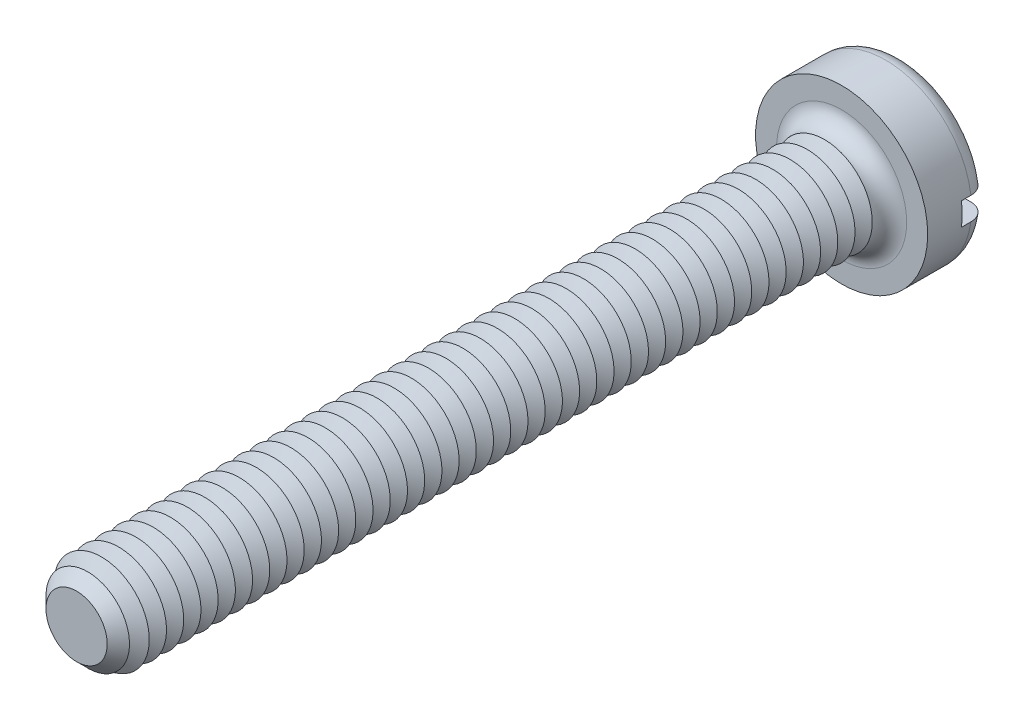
ISO-10303-21;
HEADER;
FILE_DESCRIPTION(('STEP AP214'),'2;1');
FILE_NAME('part.step','',(''),(''),'','','');
FILE_SCHEMA(('AUTOMOTIVE_DESIGN { 1 0 10303 214 1 1 1 1 }'));
ENDSEC;
DATA;
#1=APPLICATION_CONTEXT('core data for automotive mechanical design processes');
#2=APPLICATION_PROTOCOL_DEFINITION('international standard','automotive_design',2000,#1);
#3=PRODUCT_CONTEXT('',#1,'mechanical');
#4=PRODUCT('Part','Part','',(#3));
#5=PRODUCT_RELATED_PRODUCT_CATEGORY('part','',(#4));
#6=PRODUCT_DEFINITION_FORMATION('','',#4);
#7=PRODUCT_DEFINITION_CONTEXT('part definition',#1,'design');
#8=PRODUCT_DEFINITION('design','',#6,#7);
#9=PRODUCT_DEFINITION_SHAPE('','',#8);
#10=(LENGTH_UNIT() NAMED_UNIT(*) SI_UNIT(.MILLI.,.METRE.));
#11=(NAMED_UNIT(*) PLANE_ANGLE_UNIT() SI_UNIT($,.RADIAN.));
#12=(NAMED_UNIT(*) SI_UNIT($,.STERADIAN.) SOLID_ANGLE_UNIT());
#13=UNCERTAINTY_MEASURE_WITH_UNIT(LENGTH_MEASURE(1.E-05),#10,'distance_accuracy_value','');
#14=(GEOMETRIC_REPRESENTATION_CONTEXT(3) GLOBAL_UNCERTAINTY_ASSIGNED_CONTEXT((#13)) GLOBAL_UNIT_ASSIGNED_CONTEXT((#10,
#11,#12)) REPRESENTATION_CONTEXT('',''));
#15=CARTESIAN_POINT('',(0.,0.,0.));
#16=DIRECTION('',(0.,0.,1.));
#17=DIRECTION('',(1.,0.,0.));
#18=AXIS2_PLACEMENT_3D('',#15,#16,#17);
#19=CARTESIAN_POINT('',(0.,0.,-1.6));
#20=DIRECTION('',(0.,0.,1.));
#21=DIRECTION('',(1.,0.,0.));
#22=AXIS2_PLACEMENT_3D('',#19,#20,#21);
#23=PLANE('',#22);
#24=CARTESIAN_POINT('',(0.,0.,-1.6));
#25=DIRECTION('',(0.,0.,1.));
#26=DIRECTION('',(1.,0.,0.));
#27=AXIS2_PLACEMENT_3D('',#24,#25,#26);
#28=CIRCLE('',#27,1.8);
#29=CARTESIAN_POINT('',(-1.77482393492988,0.3,-1.6));
#30=VERTEX_POINT('',#29);
#31=CARTESIAN_POINT('',(1.77482393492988,0.3,-1.6));
#32=VERTEX_POINT('',#31);
#33=EDGE_CURVE('E116',#30,#32,#28,.F.);
#34=ORIENTED_EDGE('',*,*,#33,.T.);
#35=DIRECTION('',(1.,0.,0.));
#36=VECTOR('',#35,1.);
#37=CARTESIAN_POINT('',(-2.25,0.3,-1.6));
#38=LINE('',#37,#36);
#39=EDGE_CURVE('E111',#30,#32,#38,.T.);
#40=ORIENTED_EDGE('',*,*,#39,.F.);
#41=EDGE_LOOP('',(#34,#40));
#42=FACE_BOUND('',#41,.T.);
#43=ADVANCED_FACE('F39',(#42),#23,.F.);
#44=CARTESIAN_POINT('',(0.,0.,-1.15));
#45=DIRECTION('',(0.,0.,1.));
#46=DIRECTION('',(1.,0.,0.));
#47=AXIS2_PLACEMENT_3D('',#44,#45,#46);
#48=TOROIDAL_SURFACE('',#47,1.8,0.45);
#49=CARTESIAN_POINT('',(-2.09367249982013,0.3,-1.4713087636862));
#50=CARTESIAN_POINT('',(-2.07531034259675,0.3,-1.48912990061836));
#51=CARTESIAN_POINT('',(-2.05541605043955,0.3,-1.50540110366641));
#52=CARTESIAN_POINT('',(-2.01315405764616,0.3,-1.53437465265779));
#53=CARTESIAN_POINT('',(-1.99078310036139,0.3,-1.54707221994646));
#54=CARTESIAN_POINT('',(-1.94425163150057,0.3,-1.56853090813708));
#55=CARTESIAN_POINT('',(-1.92009286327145,0.3,-1.57729580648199));
#56=CARTESIAN_POINT('',(-1.8706617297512,0.3,-1.59068015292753));
#57=CARTESIAN_POINT('',(-1.84538964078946,0.3,-1.59530062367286));
#58=CARTESIAN_POINT('',(-1.7942134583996,0.3,-1.60031507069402));
#59=CARTESIAN_POINT('',(-1.76830582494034,0.3,-1.60067291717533));
#60=CARTESIAN_POINT('',(-1.71679040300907,0.3,-1.59707477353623));
#61=CARTESIAN_POINT('',(-1.69118264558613,0.3,-1.59311834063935));
#62=CARTESIAN_POINT('',(-1.64075792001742,0.3,-1.58095464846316));
#63=CARTESIAN_POINT('',(-1.61594989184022,0.3,-1.57271029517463));
#64=CARTESIAN_POINT('',(-1.56806655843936,0.3,-1.55217762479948));
#65=CARTESIAN_POINT('',(-1.54499130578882,0.3,-1.53988918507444));
#66=CARTESIAN_POINT('',(-1.50122413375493,0.3,-1.51158963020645));
#67=CARTESIAN_POINT('',(-1.48053389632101,0.3,-1.49557591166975));
#68=CARTESIAN_POINT('',(-1.44217532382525,0.3,-1.46026359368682));
#69=CARTESIAN_POINT('',(-1.42450683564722,0.3,-1.4409651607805));
#70=CARTESIAN_POINT('',(-1.39293961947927,0.3,-1.39986821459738));
#71=CARTESIAN_POINT('',(-1.37899788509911,0.3,-1.37810275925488));
#72=CARTESIAN_POINT('',(-1.35506190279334,0.3,-1.33249939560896));
#73=CARTESIAN_POINT('',(-1.34506709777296,0.3,-1.30866178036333));
#74=CARTESIAN_POINT('',(-1.3295415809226,0.3,-1.26015137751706));
#75=CARTESIAN_POINT('',(-1.32391771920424,0.3,-1.23550839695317));
#76=CARTESIAN_POINT('',(-1.31696995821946,0.3,-1.18562442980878));
#77=CARTESIAN_POINT('',(-1.31564552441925,0.3,-1.16038351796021));
#78=CARTESIAN_POINT('',(-1.31732714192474,0.3,-1.11049178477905));
#79=CARTESIAN_POINT('',(-1.32025766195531,0.3,-1.08583837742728));
#80=CARTESIAN_POINT('',(-1.3302124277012,0.3,-1.03737369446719));
#81=CARTESIAN_POINT('',(-1.33723664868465,0.3,-1.01356241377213));
#82=CARTESIAN_POINT('',(-1.35515820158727,0.3,-0.967413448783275));
#83=CARTESIAN_POINT('',(-1.36606032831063,0.3,-0.945077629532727));
#84=CARTESIAN_POINT('',(-1.39139351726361,0.3,-0.902507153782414));
#85=CARTESIAN_POINT('',(-1.40582489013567,0.3,-0.882272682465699));
#86=CARTESIAN_POINT('',(-1.43808691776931,0.3,-0.844072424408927));
#87=CARTESIAN_POINT('',(-1.4559757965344,0.3,-0.826155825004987));
#88=CARTESIAN_POINT('',(-1.49445205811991,0.3,-0.793502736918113));
#89=CARTESIAN_POINT('',(-1.51503974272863,0.3,-0.778766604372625));
#90=CARTESIAN_POINT('',(-1.55880475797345,0.3,-0.752571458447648));
#91=CARTESIAN_POINT('',(-1.58202794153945,0.3,-0.741189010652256));
#92=CARTESIAN_POINT('',(-1.63004083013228,0.3,-0.722432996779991));
#93=CARTESIAN_POINT('',(-1.65483064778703,0.3,-0.715059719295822));
#94=CARTESIAN_POINT('',(-1.70558060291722,0.3,-0.704463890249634));
#95=CARTESIAN_POINT('',(-1.73155090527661,0.3,-0.701289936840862));
#96=CARTESIAN_POINT('',(-1.78365633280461,0.3,-0.699350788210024));
#97=CARTESIAN_POINT('',(-1.80979145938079,0.3,-0.700585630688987));
#98=CARTESIAN_POINT('',(-1.86145503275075,0.3,-0.70744393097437));
#99=CARTESIAN_POINT('',(-1.88698403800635,0.3,-0.713063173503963));
#100=CARTESIAN_POINT('',(-1.93672112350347,0.3,-0.728546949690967));
#101=CARTESIAN_POINT('',(-1.96092925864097,0.3,-0.738411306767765));
#102=CARTESIAN_POINT('',(-2.00710191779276,0.3,-0.762015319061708));
#103=CARTESIAN_POINT('',(-2.02908465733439,0.3,-0.775719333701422));
#104=CARTESIAN_POINT('',(-2.0704025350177,0.3,-0.806663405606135));
#105=CARTESIAN_POINT('',(-2.08973782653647,0.3,-0.823903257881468));
#106=CARTESIAN_POINT('',(-2.12497879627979,0.3,-0.861218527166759));
#107=CARTESIAN_POINT('',(-2.1409209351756,0.3,-0.881259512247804));
#108=CARTESIAN_POINT('',(-2.16917502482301,0.3,-0.92375535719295));
#109=CARTESIAN_POINT('',(-2.18148717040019,0.3,-0.946210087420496));
#110=CARTESIAN_POINT('',(-2.20201023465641,0.3,-0.99266079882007));
#111=CARTESIAN_POINT('',(-2.21025973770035,0.3,-1.01663973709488));
#112=CARTESIAN_POINT('',(-2.22258852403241,0.3,-1.06564563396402));
#113=CARTESIAN_POINT('',(-2.22666813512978,0.3,-1.0906725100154));
#114=CARTESIAN_POINT('',(-2.23052418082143,0.3,-1.14090288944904));
#115=CARTESIAN_POINT('',(-2.23032644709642,0.3,-1.16610441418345));
#116=CARTESIAN_POINT('',(-2.22569614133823,0.3,-1.21612212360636));
#117=CARTESIAN_POINT('',(-2.2212625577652,0.3,-1.24093821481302));
#118=CARTESIAN_POINT('',(-2.20829785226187,0.3,-1.2894516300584));
#119=CARTESIAN_POINT('',(-2.19976997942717,0.3,-1.31314982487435));
#120=CARTESIAN_POINT('',(-2.17887390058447,0.3,-1.35876313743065));
#121=CARTESIAN_POINT('',(-2.1665103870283,0.3,-1.3806803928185));
#122=CARTESIAN_POINT('',(-2.14384463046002,0.3,-1.4140108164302));
#123=CARTESIAN_POINT('',(-2.13462949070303,0.3,-1.42617780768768));
#124=CARTESIAN_POINT('',(-2.1150151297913,0.3,-1.44951629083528));
#125=CARTESIAN_POINT('',(-2.10461591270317,0.3,-1.46068778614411));
#126=CARTESIAN_POINT('',(-2.09367249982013,0.3,-1.4713087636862));
#127=B_SPLINE_CURVE_WITH_KNOTS('',3,(#49,#50,#51,#52,#53,#54,#55,#56,#57,#58,#59,#60,#61,#62,
#63,#64,#65,#66,#67,#68,#69,#70,#71,#72,#73,#74,#75,#76,#77,#78,#79,#80,#81,#82,#83,#84,#85,#86,
#87,#88,#89,#90,#91,#92,#93,#94,#95,#96,#97,#98,#99,#100,#101,#102,#103,#104,#105,#106,#107,
#108,#109,#110,#111,#112,#113,#114,#115,#116,#117,#118,#119,#120,#121,#122,#123,#124,#125,#126),
.UNSPECIFIED.,.T.,.F.,(4,2,2,2,2,2,2,2,2,2,2,2,2,2,2,2,2,2,2,2,2,2,2,2,2,2,2,2,2,2,2,2,2,2,2,2,
2,2,4),(0.,0.0767085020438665,0.153519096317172,0.230255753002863,0.306973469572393,
0.384340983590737,0.461716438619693,0.539772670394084,0.617831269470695,0.695944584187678,
0.774053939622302,0.851218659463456,0.928372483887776,1.00383319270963,1.07928451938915,
1.15341274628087,1.22754052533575,1.30176027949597,1.37598656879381,1.45159320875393,
1.52720831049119,1.6044355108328,1.68166826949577,1.75978723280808,1.8379068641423,
1.91595148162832,1.99399285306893,2.07133254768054,2.14866775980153,2.22512456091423,
2.30157725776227,2.3772891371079,2.45299506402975,2.52824391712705,2.60351074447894,
2.67871794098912,2.75383349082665,2.79955010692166,2.84526656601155),.UNSPECIFIED.);
#128=CARTESIAN_POINT('',(-2.22991031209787,0.3,-1.14999999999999));
#129=VERTEX_POINT('',#128);
#130=EDGE_CURVE('E528',#129,#30,#127,.T.);
#131=ORIENTED_EDGE('',*,*,#130,.F.);
#132=CARTESIAN_POINT('',(0.,0.,-1.15));
#133=DIRECTION('',(0.,0.,1.));
#134=DIRECTION('',(1.,0.,0.));
#135=AXIS2_PLACEMENT_3D('',#132,#133,#134);
#136=CIRCLE('',#135,2.25);
#137=CARTESIAN_POINT('',(2.22991031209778,0.3,-1.15));
#138=VERTEX_POINT('',#137);
#139=EDGE_CURVE('E124',#138,#129,#136,.T.);
#140=ORIENTED_EDGE('',*,*,#139,.F.);
#141=CARTESIAN_POINT('',(1.39325818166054,0.3,-1.39903402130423));
#142=CARTESIAN_POINT('',(1.40771723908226,0.3,-1.42030595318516));
#143=CARTESIAN_POINT('',(1.4240122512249,0.3,-1.4403555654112));
#144=CARTESIAN_POINT('',(1.45976320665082,0.3,-1.4774406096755));
#145=CARTESIAN_POINT('',(1.47922380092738,0.3,-1.49447152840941));
#146=CARTESIAN_POINT('',(1.5206923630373,0.3,-1.52502510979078));
#147=CARTESIAN_POINT('',(1.54269721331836,0.3,-1.53855200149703));
#148=CARTESIAN_POINT('',(1.58863815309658,0.3,-1.56176272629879));
#149=CARTESIAN_POINT('',(1.61257369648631,0.3,-1.57144764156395));
#150=CARTESIAN_POINT('',(1.66199169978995,0.3,-1.58680804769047));
#151=CARTESIAN_POINT('',(1.68748839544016,0.3,-1.59243778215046));
#152=CARTESIAN_POINT('',(1.73906656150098,0.3,-1.59934902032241));
#153=CARTESIAN_POINT('',(1.76514807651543,0.3,-1.60063019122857));
#154=CARTESIAN_POINT('',(1.81721740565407,0.3,-1.59879130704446));
#155=CARTESIAN_POINT('',(1.84320486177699,0.3,-1.59566102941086));
#156=CARTESIAN_POINT('',(1.89427635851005,0.3,-1.58504931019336));
#157=CARTESIAN_POINT('',(1.91936042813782,0.3,-1.57756800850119));
#158=CARTESIAN_POINT('',(1.9677137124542,0.3,-1.55851722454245));
#159=CARTESIAN_POINT('',(1.99099484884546,0.3,-1.5469780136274));
#160=CARTESIAN_POINT('',(2.03525897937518,0.3,-1.52011224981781));
#161=CARTESIAN_POINT('',(2.05624211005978,0.3,-1.50478592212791));
#162=CARTESIAN_POINT('',(2.09506403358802,0.3,-1.47096472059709));
#163=CARTESIAN_POINT('',(2.11293536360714,0.3,-1.45250719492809));
#164=CARTESIAN_POINT('',(2.14528563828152,0.3,-1.41282609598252));
#165=CARTESIAN_POINT('',(2.15976477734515,0.3,-1.39160268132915));
#166=CARTESIAN_POINT('',(2.18476262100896,0.3,-1.34723254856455));
#167=CARTESIAN_POINT('',(2.19532119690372,0.3,-1.32410828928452));
#168=CARTESIAN_POINT('',(2.21237438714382,0.3,-1.27640693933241));
#169=CARTESIAN_POINT('',(2.21886918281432,0.3,-1.25182991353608));
#170=CARTESIAN_POINT('',(2.2275687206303,0.3,-1.20210937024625));
#171=CARTESIAN_POINT('',(2.22980376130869,0.3,-1.17697115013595));
#172=CARTESIAN_POINT('',(2.23000940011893,0.3,-1.12667754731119));
#173=CARTESIAN_POINT('',(2.22798009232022,0.3,-1.10152216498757));
#174=CARTESIAN_POINT('',(2.21972856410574,0.3,-1.05197773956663));
#175=CARTESIAN_POINT('',(2.21351744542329,0.3,-1.02758684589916));
#176=CARTESIAN_POINT('',(2.19709696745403,0.3,-0.980190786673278));
#177=CARTESIAN_POINT('',(2.18688760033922,0.3,-0.957185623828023));
#178=CARTESIAN_POINT('',(2.1627435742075,0.3,-0.913157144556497));
#179=CARTESIAN_POINT('',(2.14880093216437,0.3,-0.892138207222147));
#180=CARTESIAN_POINT('',(2.11760640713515,0.3,-0.852719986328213));
#181=CARTESIAN_POINT('',(2.10035443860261,0.3,-0.834320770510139));
#182=CARTESIAN_POINT('',(2.06291254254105,0.3,-0.80052923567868));
#183=CARTESIAN_POINT('',(2.04270386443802,0.3,-0.785157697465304));
#184=CARTESIAN_POINT('',(2.0000139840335,0.3,-0.757986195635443));
#185=CARTESIAN_POINT('',(1.97753267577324,0.3,-0.746186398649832));
#186=CARTESIAN_POINT('',(1.93069507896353,0.3,-0.726364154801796));
#187=CARTESIAN_POINT('',(1.90632219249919,0.3,-0.718380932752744));
#188=CARTESIAN_POINT('',(1.85658993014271,0.3,-0.706569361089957));
#189=CARTESIAN_POINT('',(1.83123049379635,0.3,-0.702741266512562));
#190=CARTESIAN_POINT('',(1.77994107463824,0.3,-0.699306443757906));
#191=CARTESIAN_POINT('',(1.75400788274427,0.3,-0.69974759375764));
#192=CARTESIAN_POINT('',(1.70257608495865,0.3,-0.704939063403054));
#193=CARTESIAN_POINT('',(1.67707750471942,0.3,-0.709689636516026));
#194=CARTESIAN_POINT('',(1.62701662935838,0.3,-0.723419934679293));
#195=CARTESIAN_POINT('',(1.60246387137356,0.3,-0.732434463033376));
#196=CARTESIAN_POINT('',(1.55521886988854,0.3,-0.754458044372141));
#197=CARTESIAN_POINT('',(1.53252668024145,0.3,-0.76746721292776));
#198=CARTESIAN_POINT('',(1.48966925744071,0.3,-0.797124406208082));
#199=CARTESIAN_POINT('',(1.46950315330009,0.3,-0.813771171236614));
#200=CARTESIAN_POINT('',(1.43229728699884,0.3,-0.850255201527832));
#201=CARTESIAN_POINT('',(1.41525734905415,0.3,-0.870092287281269));
#202=CARTESIAN_POINT('',(1.3850470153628,0.3,-0.912123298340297));
#203=CARTESIAN_POINT('',(1.37182821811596,0.3,-0.934282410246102));
#204=CARTESIAN_POINT('',(1.34939737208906,0.3,-0.980542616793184));
#205=CARTESIAN_POINT('',(1.34018456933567,0.3,-1.00464334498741));
#206=CARTESIAN_POINT('',(1.32624172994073,0.3,-1.05352472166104));
#207=CARTESIAN_POINT('',(1.32141599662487,0.3,-1.07827808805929));
#208=CARTESIAN_POINT('',(1.31606478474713,0.3,-1.12825155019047));
#209=CARTESIAN_POINT('',(1.31553992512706,0.3,-1.15347171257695));
#210=CARTESIAN_POINT('',(1.31878307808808,0.3,-1.20323022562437));
#211=CARTESIAN_POINT('',(1.32248353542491,0.3,-1.22777305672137));
#212=CARTESIAN_POINT('',(1.33394086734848,0.3,-1.27586981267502));
#213=CARTESIAN_POINT('',(1.34169274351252,0.3,-1.2994249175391));
#214=CARTESIAN_POINT('',(1.35704250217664,0.3,-1.33561898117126));
#215=CARTESIAN_POINT('',(1.36341395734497,0.3,-1.34879219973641));
#216=CARTESIAN_POINT('',(1.37741190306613,0.3,-1.37445328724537));
#217=CARTESIAN_POINT('',(1.38503837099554,0.3,-1.38694116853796));
#218=CARTESIAN_POINT('',(1.39325818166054,0.3,-1.39903402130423));
#219=B_SPLINE_CURVE_WITH_KNOTS('',3,(#141,#142,#143,#144,#145,#146,#147,#148,#149,#150,#151,
#152,#153,#154,#155,#156,#157,#158,#159,#160,#161,#162,#163,#164,#165,#166,#167,#168,#169,#170,
#171,#172,#173,#174,#175,#176,#177,#178,#179,#180,#181,#182,#183,#184,#185,#186,#187,#188,#189,
#190,#191,#192,#193,#194,#195,#196,#197,#198,#199,#200,#201,#202,#203,#204,#205,#206,#207,#208,
#209,#210,#211,#212,#213,#214,#215,#216,#217,#218),.UNSPECIFIED.,.T.,.F.,(4,2,2,2,2,2,2,2,2,2,2,
2,2,2,2,2,2,2,2,2,2,2,2,2,2,2,2,2,2,2,2,2,2,2,2,2,2,2,4),(0.,0.0771077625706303,
0.154329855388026,0.231458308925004,0.308565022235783,0.386528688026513,0.464498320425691,
0.542648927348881,0.620797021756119,0.698374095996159,0.77594655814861,0.852651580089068,
0.929352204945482,1.00524992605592,1.08114426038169,1.15649673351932,1.2318475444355,
1.30699910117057,1.38215080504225,1.45746451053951,1.53278016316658,1.60859599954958,
1.68441537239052,1.76099806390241,1.83758545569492,1.91503273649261,1.99248457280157,
2.07057979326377,2.14867727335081,2.22674775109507,2.30481383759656,2.38184276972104,
2.45885719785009,2.53414829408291,2.6094502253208,2.68356487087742,2.75758829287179,
2.80142397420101,2.84525886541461),.UNSPECIFIED.);
#220=EDGE_CURVE('E530',#32,#138,#219,.T.);
#221=ORIENTED_EDGE('',*,*,#220,.F.);
#222=ORIENTED_EDGE('',*,*,#33,.F.);
#223=EDGE_LOOP('',(#131,#140,#221,#222));
#224=FACE_BOUND('',#223,.T.);
#225=ADVANCED_FACE('F512',(#224),#48,.T.);
#226=CARTESIAN_POINT('',(0.,0.,-1.6));
#227=DIRECTION('',(0.,0.,1.));
#228=DIRECTION('',(1.,0.,0.));
#229=AXIS2_PLACEMENT_3D('',#226,#227,#228);
#230=CYLINDRICAL_SURFACE('',#229,2.25);
#231=DIRECTION('',(0.,0.,1.));
#232=VECTOR('',#231,1.);
#233=CARTESIAN_POINT('',(2.22991031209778,0.3,-1.6));
#234=LINE('',#233,#232);
#235=CARTESIAN_POINT('',(2.22991031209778,0.3,-0.9));
#236=VERTEX_POINT('',#235);
#237=EDGE_CURVE('E545',#138,#236,#234,.T.);
#238=ORIENTED_EDGE('',*,*,#237,.F.);
#239=ORIENTED_EDGE('',*,*,#139,.T.);
#240=DIRECTION('',(0.,0.,1.));
#241=VECTOR('',#240,1.);
#242=CARTESIAN_POINT('',(-2.22991031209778,0.3,-1.6));
#243=LINE('',#242,#241);
#244=CARTESIAN_POINT('',(-2.22991031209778,0.3,-0.9));
#245=VERTEX_POINT('',#244);
#246=EDGE_CURVE('E63',#245,#129,#243,.F.);
#247=ORIENTED_EDGE('',*,*,#246,.F.);
#248=CARTESIAN_POINT('',(0.,0.,-0.9));
#249=DIRECTION('',(0.,0.,-1.));
#250=DIRECTION('',(-1.,0.,0.));
#251=AXIS2_PLACEMENT_3D('',#248,#249,#250);
#252=CIRCLE('',#251,2.25);
#253=CARTESIAN_POINT('',(-2.22991031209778,-0.3,-0.9));
#254=VERTEX_POINT('',#253);
#255=EDGE_CURVE('E43',#245,#254,#252,.F.);
#256=ORIENTED_EDGE('',*,*,#255,.T.);
#257=DIRECTION('',(0.,0.,1.));
#258=VECTOR('',#257,1.);
#259=CARTESIAN_POINT('',(-2.22991031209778,-0.3,-1.6));
#260=LINE('',#259,#258);
#261=CARTESIAN_POINT('',(-2.22991031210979,-0.3,-1.15000000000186));
#262=VERTEX_POINT('',#261);
#263=EDGE_CURVE('E543',#262,#254,#260,.T.);
#264=ORIENTED_EDGE('',*,*,#263,.F.);
#265=CARTESIAN_POINT('',(2.22991031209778,-0.3,-1.15));
#266=VERTEX_POINT('',#265);
#267=EDGE_CURVE('E126',#262,#266,#136,.T.);
#268=ORIENTED_EDGE('',*,*,#267,.T.);
#269=DIRECTION('',(0.,0.,1.));
#270=VECTOR('',#269,1.);
#271=CARTESIAN_POINT('',(2.22991031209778,-0.3,-1.6));
#272=LINE('',#271,#270);
#273=CARTESIAN_POINT('',(2.22991031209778,-0.3,-0.9));
#274=VERTEX_POINT('',#273);
#275=EDGE_CURVE('E55',#274,#266,#272,.F.);
#276=ORIENTED_EDGE('',*,*,#275,.F.);
#277=EDGE_CURVE('E11',#274,#236,#252,.F.);
#278=ORIENTED_EDGE('',*,*,#277,.T.);
#279=EDGE_LOOP('',(#238,#239,#247,#256,#264,#268,#276,#278));
#280=FACE_BOUND('',#279,.T.);
#281=CARTESIAN_POINT('',(0.,0.,0.));
#282=DIRECTION('',(0.,0.,1.));
#283=DIRECTION('',(1.,0.,0.));
#284=AXIS2_PLACEMENT_3D('',#281,#282,#283);
#285=CIRCLE('',#284,2.25);
#286=CARTESIAN_POINT('',(2.25,0.,0.));
#287=VERTEX_POINT('',#286);
#288=EDGE_CURVE('E548',#287,#287,#285,.T.);
#289=ORIENTED_EDGE('',*,*,#288,.F.);
#290=EDGE_LOOP('',(#289));
#291=FACE_BOUND('',#290,.T.);
#292=ADVANCED_FACE('F508',(#280,#291),#230,.T.);
#293=CARTESIAN_POINT('',(1.77482393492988,-0.3,-1.6));
#294=VERTEX_POINT('',#293);
#295=CARTESIAN_POINT('',(-1.77482393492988,-0.3,-1.6));
#296=VERTEX_POINT('',#295);
#297=EDGE_CURVE('E109',#294,#296,#28,.F.);
#298=ORIENTED_EDGE('',*,*,#297,.T.);
#299=DIRECTION('',(-1.,0.,0.));
#300=VECTOR('',#299,1.);
#301=CARTESIAN_POINT('',(-2.25,-0.3,-1.6));
#302=LINE('',#301,#300);
#303=EDGE_CURVE('E96',#294,#296,#302,.T.);
#304=ORIENTED_EDGE('',*,*,#303,.F.);
#305=EDGE_LOOP('',(#298,#304));
#306=FACE_BOUND('',#305,.T.);
#307=ADVANCED_FACE('F108',(#306),#23,.F.);
#308=CARTESIAN_POINT('',(0.,0.,0.));
#309=DIRECTION('',(0.,0.,1.));
#310=DIRECTION('',(1.,0.,0.));
#311=AXIS2_PLACEMENT_3D('',#308,#309,#310);
#312=PLANE('',#311);
#313=CARTESIAN_POINT('',(0.,0.,0.));
#314=DIRECTION('',(0.,0.,1.));
#315=DIRECTION('',(1.,0.,0.));
#316=AXIS2_PLACEMENT_3D('',#313,#314,#315);
#317=CIRCLE('',#316,1.7);
#318=CARTESIAN_POINT('',(1.7,0.,0.));
#319=VERTEX_POINT('',#318);
#320=EDGE_CURVE('E115',#319,#319,#317,.F.);
#321=ORIENTED_EDGE('',*,*,#320,.T.);
#322=EDGE_LOOP('',(#321));
#323=FACE_BOUND('',#322,.T.);
#324=ORIENTED_EDGE('',*,*,#288,.T.);
#325=EDGE_LOOP('',(#324));
#326=FACE_BOUND('',#325,.T.);
#327=ADVANCED_FACE('F507',(#323,#326),#312,.T.);
#328=CARTESIAN_POINT('',(-2.09367249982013,-0.3,-1.4713087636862));
#329=CARTESIAN_POINT('',(-2.11176539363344,-0.3,-1.45374579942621));
#330=CARTESIAN_POINT('',(-2.1283968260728,-0.3,-1.43465254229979));
#331=CARTESIAN_POINT('',(-2.15823692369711,-0.3,-1.39393307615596));
#332=CARTESIAN_POINT('',(-2.17144184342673,-0.3,-1.37230413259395));
#333=CARTESIAN_POINT('',(-2.19402281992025,-0.3,-1.32713362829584));
#334=CARTESIAN_POINT('',(-2.20339951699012,-0.3,-1.30359238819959));
#335=CARTESIAN_POINT('',(-2.21804409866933,-0.3,-1.25527081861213));
#336=CARTESIAN_POINT('',(-2.22331295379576,-0.3,-1.23049078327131));
#337=CARTESIAN_POINT('',(-2.22957448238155,-0.3,-1.18050893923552));
#338=CARTESIAN_POINT('',(-2.23058617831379,-0.3,-1.15530951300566));
#339=CARTESIAN_POINT('',(-2.22835535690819,-0.3,-1.10509920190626));
#340=CARTESIAN_POINT('',(-2.22511277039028,-0.3,-1.08008832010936));
#341=CARTESIAN_POINT('',(-2.21448018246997,-0.3,-1.03101646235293));
#342=CARTESIAN_POINT('',(-2.20709836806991,-0.3,-1.00695371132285));
#343=CARTESIAN_POINT('',(-2.18841075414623,-0.3,-0.960404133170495));
#344=CARTESIAN_POINT('',(-2.17710493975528,-0.3,-0.937917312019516));
#345=CARTESIAN_POINT('',(-2.15086234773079,-0.3,-0.895085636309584));
#346=CARTESIAN_POINT('',(-2.13591537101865,-0.3,-0.874747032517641));
#347=CARTESIAN_POINT('',(-2.1028415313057,-0.3,-0.836845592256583));
#348=CARTESIAN_POINT('',(-2.08471458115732,-0.3,-0.819282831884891));
#349=CARTESIAN_POINT('',(-2.0456590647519,-0.3,-0.78729174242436));
#350=CARTESIAN_POINT('',(-2.0247112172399,-0.3,-0.772886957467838));
#351=CARTESIAN_POINT('',(-1.98071452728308,-0.3,-0.747756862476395));
#352=CARTESIAN_POINT('',(-1.95766557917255,-0.3,-0.737031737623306));
#353=CARTESIAN_POINT('',(-1.90986554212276,-0.3,-0.71944451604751));
#354=CARTESIAN_POINT('',(-1.88509923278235,-0.3,-0.712623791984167));
#355=CARTESIAN_POINT('',(-1.83477837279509,-0.3,-0.703186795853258));
#356=CARTESIAN_POINT('',(-1.80922377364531,-0.3,-0.700570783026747));
#357=CARTESIAN_POINT('',(-1.75774893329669,-0.3,-0.699591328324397));
#358=CARTESIAN_POINT('',(-1.73182778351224,-0.3,-0.701275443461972));
#359=CARTESIAN_POINT('',(-1.68062744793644,-0.3,-0.708937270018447));
#360=CARTESIAN_POINT('',(-1.65534829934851,-0.3,-0.714915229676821));
#361=CARTESIAN_POINT('',(-1.6059539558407,-0.3,-0.731056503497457));
#362=CARTESIAN_POINT('',(-1.58184881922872,-0.3,-0.741250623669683));
#363=CARTESIAN_POINT('',(-1.53569497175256,-0.3,-0.765548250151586));
#364=CARTESIAN_POINT('',(-1.51364629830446,-0.3,-0.779651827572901));
#365=CARTESIAN_POINT('',(-1.47229470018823,-0.3,-0.811355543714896));
#366=CARTESIAN_POINT('',(-1.45298625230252,-0.3,-0.828948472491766));
#367=CARTESIAN_POINT('',(-1.41765142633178,-0.3,-0.867170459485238));
#368=CARTESIAN_POINT('',(-1.40162480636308,-0.3,-0.887799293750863));
#369=CARTESIAN_POINT('',(-1.37358365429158,-0.3,-0.93118317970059));
#370=CARTESIAN_POINT('',(-1.3615121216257,-0.3,-0.953901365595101));
#371=CARTESIAN_POINT('',(-1.34145576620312,-0.3,-1.00107529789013));
#372=CARTESIAN_POINT('',(-1.33347032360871,-0.3,-1.02553078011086));
#373=CARTESIAN_POINT('',(-1.32199536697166,-0.3,-1.07489401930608));
#374=CARTESIAN_POINT('',(-1.31840873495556,-0.3,-1.09977921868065));
#375=CARTESIAN_POINT('',(-1.31553052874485,-0.3,-1.1497957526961));
#376=CARTESIAN_POINT('',(-1.31623852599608,-0.3,-1.17492706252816));
#377=CARTESIAN_POINT('',(-1.32188368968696,-0.3,-1.22435119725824));
#378=CARTESIAN_POINT('',(-1.32676151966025,-0.3,-1.24865083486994));
#379=CARTESIAN_POINT('',(-1.34050334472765,-0.3,-1.29609421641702));
#380=CARTESIAN_POINT('',(-1.34936742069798,-0.3,-1.31923793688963));
#381=CARTESIAN_POINT('',(-1.37086295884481,-0.3,-1.36387796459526));
#382=CARTESIAN_POINT('',(-1.38351729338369,-0.3,-1.38536324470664));
#383=CARTESIAN_POINT('',(-1.41218367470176,-0.3,-1.42596199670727));
#384=CARTESIAN_POINT('',(-1.42819606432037,-0.3,-1.44507522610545));
#385=CARTESIAN_POINT('',(-1.46347664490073,-0.3,-1.48081087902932));
#386=CARTESIAN_POINT('',(-1.48280543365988,-0.3,-1.49737347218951));
#387=CARTESIAN_POINT('',(-1.5239232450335,-0.3,-1.52709508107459));
#388=CARTESIAN_POINT('',(-1.54571253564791,-0.3,-1.54025372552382));
#389=CARTESIAN_POINT('',(-1.59160097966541,-0.3,-1.56305446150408));
#390=CARTESIAN_POINT('',(-1.61573734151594,-0.3,-1.57262172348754));
#391=CARTESIAN_POINT('',(-1.66526504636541,-0.3,-1.58760700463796));
#392=CARTESIAN_POINT('',(-1.69065641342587,-0.3,-1.59302494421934));
#393=CARTESIAN_POINT('',(-1.74220154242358,-0.3,-1.59958446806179));
#394=CARTESIAN_POINT('',(-1.7683598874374,-0.3,-1.60069012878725));
#395=CARTESIAN_POINT('',(-1.82049681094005,-0.3,-1.59847888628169));
#396=CARTESIAN_POINT('',(-1.8464753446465,-0.3,-1.59516091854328));
#397=CARTESIAN_POINT('',(-1.89742078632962,-0.3,-1.58419269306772));
#398=CARTESIAN_POINT('',(-1.92239041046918,-0.3,-1.57655503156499));
#399=CARTESIAN_POINT('',(-1.97064988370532,-0.3,-1.55715679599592));
#400=CARTESIAN_POINT('',(-1.99394179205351,-0.3,-1.54540138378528));
#401=CARTESIAN_POINT('',(-2.03003215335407,-0.3,-1.52312594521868));
#402=CARTESIAN_POINT('',(-2.04354254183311,-0.3,-1.51373809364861));
#403=CARTESIAN_POINT('',(-2.06946640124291,-0.3,-1.49355310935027));
#404=CARTESIAN_POINT('',(-2.08187987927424,-0.3,-1.48275598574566));
#405=CARTESIAN_POINT('',(-2.09367249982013,-0.3,-1.4713087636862));
#406=B_SPLINE_CURVE_WITH_KNOTS('',3,(#328,#329,#330,#331,#332,#333,#334,#335,#336,#337,#338,
#339,#340,#341,#342,#343,#344,#345,#346,#347,#348,#349,#350,#351,#352,#353,#354,#355,#356,#357,
#358,#359,#360,#361,#362,#363,#364,#365,#366,#367,#368,#369,#370,#371,#372,#373,#374,#375,#376,
#377,#378,#379,#380,#381,#382,#383,#384,#385,#386,#387,#388,#389,#390,#391,#392,#393,#394,#395,
#396,#397,#398,#399,#400,#401,#402,#403,#404,#405),.UNSPECIFIED.,.T.,.F.,(4,2,2,2,2,2,2,2,2,2,2,
2,2,2,2,2,2,2,2,2,2,2,2,2,2,2,2,2,2,2,2,2,2,2,2,2,2,2,4),(0.,0.0755864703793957,
0.151255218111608,0.226911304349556,0.302549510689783,0.377849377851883,0.453150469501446,
0.528303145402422,0.603456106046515,0.67882204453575,0.754190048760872,0.83010216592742,
0.906018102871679,0.982724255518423,1.05943513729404,1.13699806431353,1.21456547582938,
1.29270994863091,1.37085584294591,1.44884191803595,1.52682224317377,1.60362346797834,
1.68041303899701,1.75547480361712,1.83052907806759,1.90453278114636,1.97853798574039,
2.05299909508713,2.12746781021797,2.20347986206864,2.27950020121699,2.3570265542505,
2.43455439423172,2.5127267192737,2.59091785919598,2.66888216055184,2.74674907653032,
2.79601528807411,2.84528118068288),.UNSPECIFIED.);
#407=EDGE_CURVE('E103',#296,#262,#406,.T.);
#408=ORIENTED_EDGE('',*,*,#407,.F.);
#409=ORIENTED_EDGE('',*,*,#297,.F.);
#410=CARTESIAN_POINT('',(1.39325818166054,-0.3,-1.39903402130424));
#411=CARTESIAN_POINT('',(1.37924349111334,-0.3,-1.37841200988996));
#412=CARTESIAN_POINT('',(1.36693374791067,-0.3,-1.35661225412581));
#413=CARTESIAN_POINT('',(1.34612289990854,-0.3,-1.31124547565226));
#414=CARTESIAN_POINT('',(1.33762533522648,-0.3,-1.28767683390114));
#415=CARTESIAN_POINT('',(1.32472877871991,-0.3,-1.23943261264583));
#416=CARTESIAN_POINT('',(1.3203309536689,-0.3,-1.21475672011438));
#417=CARTESIAN_POINT('',(1.31579198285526,-0.3,-1.16502199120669));
#418=CARTESIAN_POINT('',(1.31564980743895,-0.3,-1.13996324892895));
#419=CARTESIAN_POINT('',(1.31960322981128,-0.3,-1.09044336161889));
#420=CARTESIAN_POINT('',(1.32365524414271,-0.3,-1.06597872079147));
#421=CARTESIAN_POINT('',(1.33579339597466,-0.3,-1.01807218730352));
#422=CARTESIAN_POINT('',(1.34387971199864,-0.3,-0.994630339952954));
#423=CARTESIAN_POINT('',(1.36386460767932,-0.3,-0.949319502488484));
#424=CARTESIAN_POINT('',(1.37577869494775,-0.3,-0.92745736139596));
#425=CARTESIAN_POINT('',(1.40303929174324,-0.3,-0.885990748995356));
#426=CARTESIAN_POINT('',(1.41838612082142,-0.3,-0.866386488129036));
#427=CARTESIAN_POINT('',(1.45239955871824,-0.3,-0.829572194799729));
#428=CARTESIAN_POINT('',(1.47112624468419,-0.3,-0.812417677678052));
#429=CARTESIAN_POINT('',(1.51114353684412,-0.3,-0.78141873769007));
#430=CARTESIAN_POINT('',(1.53243442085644,-0.3,-0.767574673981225));
#431=CARTESIAN_POINT('',(1.57744959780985,-0.3,-0.743302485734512));
#432=CARTESIAN_POINT('',(1.6012148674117,-0.3,-0.732950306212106));
#433=CARTESIAN_POINT('',(1.65013556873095,-0.3,-0.71633816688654));
#434=CARTESIAN_POINT('',(1.67529109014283,-0.3,-0.710078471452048));
#435=CARTESIAN_POINT('',(1.72654223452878,-0.3,-0.701786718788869));
#436=CARTESIAN_POINT('',(1.75264462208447,-0.3,-0.699796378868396));
#437=CARTESIAN_POINT('',(1.80481283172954,-0.3,-0.700236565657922));
#438=CARTESIAN_POINT('',(1.83087865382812,-0.3,-0.702667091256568));
#439=CARTESIAN_POINT('',(1.88216421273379,-0.3,-0.71188843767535));
#440=CARTESIAN_POINT('',(1.90738581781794,-0.3,-0.718668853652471));
#441=CARTESIAN_POINT('',(1.95631449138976,-0.3,-0.736408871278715));
#442=CARTESIAN_POINT('',(1.98002162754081,-0.3,-0.747368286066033));
#443=CARTESIAN_POINT('',(2.02500221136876,-0.3,-0.773046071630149));
#444=CARTESIAN_POINT('',(2.04629687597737,-0.3,-0.78772726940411));
#445=CARTESIAN_POINT('',(2.08608258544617,-0.3,-0.820494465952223));
#446=CARTESIAN_POINT('',(2.10457379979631,-0.3,-0.838580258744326));
#447=CARTESIAN_POINT('',(2.1380062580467,-0.3,-0.877422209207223));
#448=CARTESIAN_POINT('',(2.15298532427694,-0.3,-0.898145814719));
#449=CARTESIAN_POINT('',(2.17921311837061,-0.3,-0.941832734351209));
#450=CARTESIAN_POINT('',(2.19046204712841,-0.3,-0.964795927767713));
#451=CARTESIAN_POINT('',(2.20880507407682,-0.3,-1.01207981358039));
#452=CARTESIAN_POINT('',(2.2159367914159,-0.3,-1.0363859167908));
#453=CARTESIAN_POINT('',(2.22599386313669,-0.3,-1.08585317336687));
#454=CARTESIAN_POINT('',(2.22891936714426,-0.3,-1.11101429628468));
#455=CARTESIAN_POINT('',(2.23047255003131,-0.3,-1.16133395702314));
#456=CARTESIAN_POINT('',(2.22912306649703,-0.3,-1.18649179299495));
#457=CARTESIAN_POINT('',(2.22221641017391,-0.3,-1.236222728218));
#458=CARTESIAN_POINT('',(2.21665928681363,-0.3,-1.26079583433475));
#459=CARTESIAN_POINT('',(2.20150655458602,-0.3,-1.30864604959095));
#460=CARTESIAN_POINT('',(2.19191347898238,-0.3,-1.3319239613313));
#461=CARTESIAN_POINT('',(2.16897085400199,-0.3,-1.37654778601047));
#462=CARTESIAN_POINT('',(2.15562126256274,-0.3,-1.39789367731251));
#463=CARTESIAN_POINT('',(2.12549147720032,-0.3,-1.43814583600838));
#464=CARTESIAN_POINT('',(2.1086973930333,-0.3,-1.45704170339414));
#465=CARTESIAN_POINT('',(2.07219852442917,-0.3,-1.491773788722));
#466=CARTESIAN_POINT('',(2.0524936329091,-0.3,-1.50760989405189));
#467=CARTESIAN_POINT('',(2.01056127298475,-0.3,-1.53591667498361));
#468=CARTESIAN_POINT('',(1.98831430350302,-0.3,-1.54835845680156));
#469=CARTESIAN_POINT('',(1.94206418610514,-0.3,-1.5693763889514));
#470=CARTESIAN_POINT('',(1.91806093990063,-0.3,-1.57795232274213));
#471=CARTESIAN_POINT('',(1.86869953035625,-0.3,-1.5910955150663));
#472=CARTESIAN_POINT('',(1.84332941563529,-0.3,-1.59561788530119));
#473=CARTESIAN_POINT('',(1.7921914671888,-0.3,-1.60038767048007));
#474=CARTESIAN_POINT('',(1.76642362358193,-0.3,-1.60063497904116));
#475=CARTESIAN_POINT('',(1.71493241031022,-0.3,-1.59684388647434));
#476=CARTESIAN_POINT('',(1.6892123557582,-0.3,-1.59276040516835));
#477=CARTESIAN_POINT('',(1.63880694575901,-0.3,-1.58035661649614));
#478=CARTESIAN_POINT('',(1.61412189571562,-0.3,-1.5720350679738));
#479=CARTESIAN_POINT('',(1.56635013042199,-0.3,-1.55132424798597));
#480=CARTESIAN_POINT('',(1.54327365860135,-0.3,-1.53891136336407));
#481=CARTESIAN_POINT('',(1.49956705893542,-0.3,-1.51037484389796));
#482=CARTESIAN_POINT('',(1.478934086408,-0.3,-1.49425558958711));
#483=CARTESIAN_POINT('',(1.44732882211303,-0.3,-1.46489751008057));
#484=CARTESIAN_POINT('',(1.43548118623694,-0.3,-1.45258668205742));
#485=CARTESIAN_POINT('',(1.41324217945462,-0.3,-1.42671249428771));
#486=CARTESIAN_POINT('',(1.40285079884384,-0.3,-1.41314914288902));
#487=CARTESIAN_POINT('',(1.39325818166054,-0.3,-1.39903402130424));
#488=B_SPLINE_CURVE_WITH_KNOTS('',3,(#410,#411,#412,#413,#414,#415,#416,#417,#418,#419,#420,
#421,#422,#423,#424,#425,#426,#427,#428,#429,#430,#431,#432,#433,#434,#435,#436,#437,#438,#439,
#440,#441,#442,#443,#444,#445,#446,#447,#448,#449,#450,#451,#452,#453,#454,#455,#456,#457,#458,
#459,#460,#461,#462,#463,#464,#465,#466,#467,#468,#469,#470,#471,#472,#473,#474,#475,#476,#477,
#478,#479,#480,#481,#482,#483,#484,#485,#486,#487),.UNSPECIFIED.,.T.,.F.,(4,2,2,2,2,2,2,2,2,2,2,
2,2,2,2,2,2,2,2,2,2,2,2,2,2,2,2,2,2,2,2,2,2,2,2,2,2,2,4),(0.,0.0747398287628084,
0.149548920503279,0.224379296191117,0.29919156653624,0.373234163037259,0.447280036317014,
0.521629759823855,0.595986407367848,0.671825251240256,0.747672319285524,0.825076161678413,
0.902485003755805,0.980646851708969,1.05880868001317,1.13678424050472,1.21475631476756,
1.29197834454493,1.36919570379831,1.44553881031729,1.52187780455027,1.59750777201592,
1.67313504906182,1.74835899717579,1.82358206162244,1.89875798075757,1.97393474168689,
2.04942084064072,2.12490971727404,2.20102244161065,2.27713942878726,2.35408926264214,
2.43104101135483,2.50880170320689,2.58658518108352,2.66482568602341,2.74297419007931,
2.79413160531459,2.84528867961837),.UNSPECIFIED.);
#489=EDGE_CURVE('E92',#266,#294,#488,.T.);
#490=ORIENTED_EDGE('',*,*,#489,.F.);
#491=ORIENTED_EDGE('',*,*,#267,.F.);
#492=EDGE_LOOP('',(#408,#409,#490,#491));
#493=FACE_BOUND('',#492,.T.);
#494=ADVANCED_FACE('F113',(#493),#48,.T.);
#495=CARTESIAN_POINT('',(0.,0.,0.449999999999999));
#496=DIRECTION('',(0.,0.,1.));
#497=DIRECTION('',(1.,0.,0.));
#498=AXIS2_PLACEMENT_3D('',#495,#496,#497);
#499=TOROIDAL_SURFACE('',#498,1.7,0.45);
#500=ORIENTED_EDGE('',*,*,#320,.F.);
#501=EDGE_LOOP('',(#500));
#502=FACE_BOUND('',#501,.T.);
#503=CARTESIAN_POINT('',(0.,0.,0.449999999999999));
#504=DIRECTION('',(0.,0.,-1.));
#505=DIRECTION('',(-1.,0.,0.));
#506=AXIS2_PLACEMENT_3D('',#503,#504,#505);
#507=CIRCLE('',#506,1.25);
#508=CARTESIAN_POINT('',(-1.25,0.,0.449999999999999));
#509=VERTEX_POINT('',#508);
#510=EDGE_CURVE('E553',#509,#509,#507,.T.);
#511=ORIENTED_EDGE('',*,*,#510,.T.);
#512=EDGE_LOOP('',(#511));
#513=FACE_BOUND('',#512,.T.);
#514=ADVANCED_FACE('F500',(#502,#513),#499,.F.);
#515=CARTESIAN_POINT('',(0.,0.,0.674999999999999));
#516=DIRECTION('',(0.,0.,-1.));
#517=DIRECTION('',(-1.,0.,0.));
#518=AXIS2_PLACEMENT_3D('',#515,#516,#517);
#519=CONICAL_SURFACE('',#518,0.860288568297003,1.0471975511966);
#520=ORIENTED_EDGE('',*,*,#510,.F.);
#521=EDGE_LOOP('',(#520));
#522=FACE_BOUND('',#521,.T.);
#523=CARTESIAN_POINT('',(0.,0.,0.674999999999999));
#524=DIRECTION('',(0.,0.,-1.));
#525=DIRECTION('',(-1.,0.,0.));
#526=AXIS2_PLACEMENT_3D('',#523,#524,#525);
#527=CIRCLE('',#526,0.860288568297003);
#528=CARTESIAN_POINT('',(-0.860288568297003,0.,0.674999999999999));
#529=VERTEX_POINT('',#528);
#530=EDGE_CURVE('E558',#529,#529,#527,.T.);
#531=ORIENTED_EDGE('',*,*,#530,.T.);
#532=EDGE_LOOP('',(#531));
#533=FACE_BOUND('',#532,.T.);
#534=ADVANCED_FACE('F496',(#522,#533),#519,.T.);
#535=CARTESIAN_POINT('',(0.,0.,0.899999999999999));
#536=DIRECTION('',(0.,0.,1.));
#537=DIRECTION('',(1.,0.,0.));
#538=AXIS2_PLACEMENT_3D('',#535,#536,#537);
#539=CONICAL_SURFACE('',#538,1.25,1.0471975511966);
#540=ORIENTED_EDGE('',*,*,#530,.F.);
#541=EDGE_LOOP('',(#540));
#542=FACE_BOUND('',#541,.T.);
#543=CARTESIAN_POINT('',(0.,0.,0.899999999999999));
#544=DIRECTION('',(0.,0.,-1.));
#545=DIRECTION('',(-1.,0.,0.));
#546=AXIS2_PLACEMENT_3D('',#543,#544,#545);
#547=CIRCLE('',#546,1.25);
#548=CARTESIAN_POINT('',(-1.25,0.,0.899999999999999));
#549=VERTEX_POINT('',#548);
#550=EDGE_CURVE('E564',#549,#549,#547,.T.);
#551=ORIENTED_EDGE('',*,*,#550,.T.);
#552=EDGE_LOOP('',(#551));
#553=FACE_BOUND('',#552,.T.);
#554=ADVANCED_FACE('F492',(#542,#553),#539,.T.);
#555=CARTESIAN_POINT('',(0.,0.,1.125));
#556=DIRECTION('',(0.,0.,-1.));
#557=DIRECTION('',(-1.,0.,0.));
#558=AXIS2_PLACEMENT_3D('',#555,#556,#557);
#559=CONICAL_SURFACE('',#558,0.860288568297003,1.0471975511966);
#560=ORIENTED_EDGE('',*,*,#550,.F.);
#561=EDGE_LOOP('',(#560));
#562=FACE_BOUND('',#561,.T.);
#563=CARTESIAN_POINT('',(0.,0.,1.125));
#564=DIRECTION('',(0.,0.,-1.));
#565=DIRECTION('',(-1.,0.,0.));
#566=AXIS2_PLACEMENT_3D('',#563,#564,#565);
#567=CIRCLE('',#566,0.860288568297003);
#568=CARTESIAN_POINT('',(-0.860288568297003,0.,1.125));
#569=VERTEX_POINT('',#568);
#570=EDGE_CURVE('E568',#569,#569,#567,.T.);
#571=ORIENTED_EDGE('',*,*,#570,.T.);
#572=EDGE_LOOP('',(#571));
#573=FACE_BOUND('',#572,.T.);
#574=ADVANCED_FACE('F488',(#562,#573),#559,.T.);
#575=CARTESIAN_POINT('',(0.,0.,1.35));
#576=DIRECTION('',(0.,0.,1.));
#577=DIRECTION('',(1.,0.,0.));
#578=AXIS2_PLACEMENT_3D('',#575,#576,#577);
#579=CONICAL_SURFACE('',#578,1.25,1.0471975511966);
#580=ORIENTED_EDGE('',*,*,#570,.F.);
#581=EDGE_LOOP('',(#580));
#582=FACE_BOUND('',#581,.T.);
#583=CARTESIAN_POINT('',(0.,0.,1.35));
#584=DIRECTION('',(0.,0.,-1.));
#585=DIRECTION('',(-1.,0.,0.));
#586=AXIS2_PLACEMENT_3D('',#583,#584,#585);
#587=CIRCLE('',#586,1.25);
#588=CARTESIAN_POINT('',(-1.25,0.,1.35));
#589=VERTEX_POINT('',#588);
#590=EDGE_CURVE('E572',#589,#589,#587,.T.);
#591=ORIENTED_EDGE('',*,*,#590,.T.);
#592=EDGE_LOOP('',(#591));
#593=FACE_BOUND('',#592,.T.);
#594=ADVANCED_FACE('F484',(#582,#593),#579,.T.);
#595=CARTESIAN_POINT('',(0.,0.,1.575));
#596=DIRECTION('',(0.,0.,-1.));
#597=DIRECTION('',(-1.,0.,0.));
#598=AXIS2_PLACEMENT_3D('',#595,#596,#597);
#599=CONICAL_SURFACE('',#598,0.860288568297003,1.0471975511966);
#600=ORIENTED_EDGE('',*,*,#590,.F.);
#601=EDGE_LOOP('',(#600));
#602=FACE_BOUND('',#601,.T.);
#603=CARTESIAN_POINT('',(0.,0.,1.575));
#604=DIRECTION('',(0.,0.,-1.));
#605=DIRECTION('',(-1.,0.,0.));
#606=AXIS2_PLACEMENT_3D('',#603,#604,#605);
#607=CIRCLE('',#606,0.860288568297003);
#608=CARTESIAN_POINT('',(-0.860288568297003,0.,1.575));
#609=VERTEX_POINT('',#608);
#610=EDGE_CURVE('E576',#609,#609,#607,.T.);
#611=ORIENTED_EDGE('',*,*,#610,.T.);
#612=EDGE_LOOP('',(#611));
#613=FACE_BOUND('',#612,.T.);
#614=ADVANCED_FACE('F480',(#602,#613),#599,.T.);
#615=CARTESIAN_POINT('',(0.,0.,1.8));
#616=DIRECTION('',(0.,0.,1.));
#617=DIRECTION('',(1.,0.,0.));
#618=AXIS2_PLACEMENT_3D('',#615,#616,#617);
#619=CONICAL_SURFACE('',#618,1.25,1.0471975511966);
#620=ORIENTED_EDGE('',*,*,#610,.F.);
#621=EDGE_LOOP('',(#620));
#622=FACE_BOUND('',#621,.T.);
#623=CARTESIAN_POINT('',(0.,0.,1.8));
#624=DIRECTION('',(0.,0.,-1.));
#625=DIRECTION('',(-1.,0.,0.));
#626=AXIS2_PLACEMENT_3D('',#623,#624,#625);
#627=CIRCLE('',#626,1.25);
#628=CARTESIAN_POINT('',(-1.25,0.,1.8));
#629=VERTEX_POINT('',#628);
#630=EDGE_CURVE('E580',#629,#629,#627,.T.);
#631=ORIENTED_EDGE('',*,*,#630,.T.);
#632=EDGE_LOOP('',(#631));
#633=FACE_BOUND('',#632,.T.);
#634=ADVANCED_FACE('F476',(#622,#633),#619,.T.);
#635=CARTESIAN_POINT('',(0.,0.,2.025));
#636=DIRECTION('',(0.,0.,-1.));
#637=DIRECTION('',(-1.,0.,0.));
#638=AXIS2_PLACEMENT_3D('',#635,#636,#637);
#639=CONICAL_SURFACE('',#638,0.860288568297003,1.0471975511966);
#640=ORIENTED_EDGE('',*,*,#630,.F.);
#641=EDGE_LOOP('',(#640));
#642=FACE_BOUND('',#641,.T.);
#643=CARTESIAN_POINT('',(0.,0.,2.025));
#644=DIRECTION('',(0.,0.,-1.));
#645=DIRECTION('',(-1.,0.,0.));
#646=AXIS2_PLACEMENT_3D('',#643,#644,#645);
#647=CIRCLE('',#646,0.860288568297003);
#648=CARTESIAN_POINT('',(-0.860288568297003,0.,2.025));
#649=VERTEX_POINT('',#648);
#650=EDGE_CURVE('E583',#649,#649,#647,.T.);
#651=ORIENTED_EDGE('',*,*,#650,.T.);
#652=EDGE_LOOP('',(#651));
#653=FACE_BOUND('',#652,.T.);
#654=ADVANCED_FACE('F472',(#642,#653),#639,.T.);
#655=CARTESIAN_POINT('',(0.,0.,2.25));
#656=DIRECTION('',(0.,0.,1.));
#657=DIRECTION('',(1.,0.,0.));
#658=AXIS2_PLACEMENT_3D('',#655,#656,#657);
#659=CONICAL_SURFACE('',#658,1.25,1.0471975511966);
#660=ORIENTED_EDGE('',*,*,#650,.F.);
#661=EDGE_LOOP('',(#660));
#662=FACE_BOUND('',#661,.T.);
#663=CARTESIAN_POINT('',(0.,0.,2.25));
#664=DIRECTION('',(0.,0.,-1.));
#665=DIRECTION('',(-1.,0.,0.));
#666=AXIS2_PLACEMENT_3D('',#663,#664,#665);
#667=CIRCLE('',#666,1.25);
#668=CARTESIAN_POINT('',(-1.25,0.,2.25));
#669=VERTEX_POINT('',#668);
#670=EDGE_CURVE('E587',#669,#669,#667,.T.);
#671=ORIENTED_EDGE('',*,*,#670,.T.);
#672=EDGE_LOOP('',(#671));
#673=FACE_BOUND('',#672,.T.);
#674=ADVANCED_FACE('F468',(#662,#673),#659,.T.);
#675=CARTESIAN_POINT('',(0.,0.,2.475));
#676=DIRECTION('',(0.,0.,-1.));
#677=DIRECTION('',(-1.,0.,0.));
#678=AXIS2_PLACEMENT_3D('',#675,#676,#677);
#679=CONICAL_SURFACE('',#678,0.860288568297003,1.0471975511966);
#680=ORIENTED_EDGE('',*,*,#670,.F.);
#681=EDGE_LOOP('',(#680));
#682=FACE_BOUND('',#681,.T.);
#683=CARTESIAN_POINT('',(0.,0.,2.475));
#684=DIRECTION('',(0.,0.,-1.));
#685=DIRECTION('',(-1.,0.,0.));
#686=AXIS2_PLACEMENT_3D('',#683,#684,#685);
#687=CIRCLE('',#686,0.860288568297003);
#688=CARTESIAN_POINT('',(-0.860288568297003,0.,2.475));
#689=VERTEX_POINT('',#688);
#690=EDGE_CURVE('E591',#689,#689,#687,.T.);
#691=ORIENTED_EDGE('',*,*,#690,.T.);
#692=EDGE_LOOP('',(#691));
#693=FACE_BOUND('',#692,.T.);
#694=ADVANCED_FACE('F464',(#682,#693),#679,.T.);
#695=CARTESIAN_POINT('',(0.,0.,2.7));
#696=DIRECTION('',(0.,0.,1.));
#697=DIRECTION('',(1.,0.,0.));
#698=AXIS2_PLACEMENT_3D('',#695,#696,#697);
#699=CONICAL_SURFACE('',#698,1.25,1.0471975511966);
#700=ORIENTED_EDGE('',*,*,#690,.F.);
#701=EDGE_LOOP('',(#700));
#702=FACE_BOUND('',#701,.T.);
#703=CARTESIAN_POINT('',(0.,0.,2.7));
#704=DIRECTION('',(0.,0.,-1.));
#705=DIRECTION('',(-1.,0.,0.));
#706=AXIS2_PLACEMENT_3D('',#703,#704,#705);
#707=CIRCLE('',#706,1.25);
#708=CARTESIAN_POINT('',(-1.25,0.,2.7));
#709=VERTEX_POINT('',#708);
#710=EDGE_CURVE('E595',#709,#709,#707,.T.);
#711=ORIENTED_EDGE('',*,*,#710,.T.);
#712=EDGE_LOOP('',(#711));
#713=FACE_BOUND('',#712,.T.);
#714=ADVANCED_FACE('F460',(#702,#713),#699,.T.);
#715=CARTESIAN_POINT('',(0.,0.,2.925));
#716=DIRECTION('',(0.,0.,-1.));
#717=DIRECTION('',(-1.,0.,0.));
#718=AXIS2_PLACEMENT_3D('',#715,#716,#717);
#719=CONICAL_SURFACE('',#718,0.860288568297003,1.0471975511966);
#720=ORIENTED_EDGE('',*,*,#710,.F.);
#721=EDGE_LOOP('',(#720));
#722=FACE_BOUND('',#721,.T.);
#723=CARTESIAN_POINT('',(0.,0.,2.925));
#724=DIRECTION('',(0.,0.,-1.));
#725=DIRECTION('',(-1.,0.,0.));
#726=AXIS2_PLACEMENT_3D('',#723,#724,#725);
#727=CIRCLE('',#726,0.860288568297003);
#728=CARTESIAN_POINT('',(-0.860288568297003,0.,2.925));
#729=VERTEX_POINT('',#728);
#730=EDGE_CURVE('E599',#729,#729,#727,.T.);
#731=ORIENTED_EDGE('',*,*,#730,.T.);
#732=EDGE_LOOP('',(#731));
#733=FACE_BOUND('',#732,.T.);
#734=ADVANCED_FACE('F456',(#722,#733),#719,.T.);
#735=CARTESIAN_POINT('',(0.,0.,3.15));
#736=DIRECTION('',(0.,0.,1.));
#737=DIRECTION('',(1.,0.,0.));
#738=AXIS2_PLACEMENT_3D('',#735,#736,#737);
#739=CONICAL_SURFACE('',#738,1.25,1.0471975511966);
#740=ORIENTED_EDGE('',*,*,#730,.F.);
#741=EDGE_LOOP('',(#740));
#742=FACE_BOUND('',#741,.T.);
#743=CARTESIAN_POINT('',(0.,0.,3.15));
#744=DIRECTION('',(0.,0.,-1.));
#745=DIRECTION('',(-1.,0.,0.));
#746=AXIS2_PLACEMENT_3D('',#743,#744,#745);
#747=CIRCLE('',#746,1.25);
#748=CARTESIAN_POINT('',(-1.25,0.,3.15));
#749=VERTEX_POINT('',#748);
#750=EDGE_CURVE('E603',#749,#749,#747,.T.);
#751=ORIENTED_EDGE('',*,*,#750,.T.);
#752=EDGE_LOOP('',(#751));
#753=FACE_BOUND('',#752,.T.);
#754=ADVANCED_FACE('F452',(#742,#753),#739,.T.);
#755=CARTESIAN_POINT('',(0.,0.,3.375));
#756=DIRECTION('',(0.,0.,-1.));
#757=DIRECTION('',(-1.,0.,0.));
#758=AXIS2_PLACEMENT_3D('',#755,#756,#757);
#759=CONICAL_SURFACE('',#758,0.860288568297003,1.0471975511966);
#760=ORIENTED_EDGE('',*,*,#750,.F.);
#761=EDGE_LOOP('',(#760));
#762=FACE_BOUND('',#761,.T.);
#763=CARTESIAN_POINT('',(0.,0.,3.375));
#764=DIRECTION('',(0.,0.,-1.));
#765=DIRECTION('',(-1.,0.,0.));
#766=AXIS2_PLACEMENT_3D('',#763,#764,#765);
#767=CIRCLE('',#766,0.860288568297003);
#768=CARTESIAN_POINT('',(-0.860288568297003,0.,3.375));
#769=VERTEX_POINT('',#768);
#770=EDGE_CURVE('E607',#769,#769,#767,.T.);
#771=ORIENTED_EDGE('',*,*,#770,.T.);
#772=EDGE_LOOP('',(#771));
#773=FACE_BOUND('',#772,.T.);
#774=ADVANCED_FACE('F448',(#762,#773),#759,.T.);
#775=CARTESIAN_POINT('',(0.,0.,3.6));
#776=DIRECTION('',(0.,0.,1.));
#777=DIRECTION('',(1.,0.,0.));
#778=AXIS2_PLACEMENT_3D('',#775,#776,#777);
#779=CONICAL_SURFACE('',#778,1.25,1.0471975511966);
#780=ORIENTED_EDGE('',*,*,#770,.F.);
#781=EDGE_LOOP('',(#780));
#782=FACE_BOUND('',#781,.T.);
#783=CARTESIAN_POINT('',(0.,0.,3.6));
#784=DIRECTION('',(0.,0.,-1.));
#785=DIRECTION('',(-1.,0.,0.));
#786=AXIS2_PLACEMENT_3D('',#783,#784,#785);
#787=CIRCLE('',#786,1.25);
#788=CARTESIAN_POINT('',(-1.25,0.,3.6));
#789=VERTEX_POINT('',#788);
#790=EDGE_CURVE('E610',#789,#789,#787,.T.);
#791=ORIENTED_EDGE('',*,*,#790,.T.);
#792=EDGE_LOOP('',(#791));
#793=FACE_BOUND('',#792,.T.);
#794=ADVANCED_FACE('F444',(#782,#793),#779,.T.);
#795=CARTESIAN_POINT('',(0.,0.,3.825));
#796=DIRECTION('',(0.,0.,-1.));
#797=DIRECTION('',(-1.,0.,0.));
#798=AXIS2_PLACEMENT_3D('',#795,#796,#797);
#799=CONICAL_SURFACE('',#798,0.860288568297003,1.0471975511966);
#800=ORIENTED_EDGE('',*,*,#790,.F.);
#801=EDGE_LOOP('',(#800));
#802=FACE_BOUND('',#801,.T.);
#803=CARTESIAN_POINT('',(0.,0.,3.825));
#804=DIRECTION('',(0.,0.,-1.));
#805=DIRECTION('',(-1.,0.,0.));
#806=AXIS2_PLACEMENT_3D('',#803,#804,#805);
#807=CIRCLE('',#806,0.860288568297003);
#808=CARTESIAN_POINT('',(-0.860288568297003,0.,3.825));
#809=VERTEX_POINT('',#808);
#810=EDGE_CURVE('E613',#809,#809,#807,.T.);
#811=ORIENTED_EDGE('',*,*,#810,.T.);
#812=EDGE_LOOP('',(#811));
#813=FACE_BOUND('',#812,.T.);
#814=ADVANCED_FACE('F440',(#802,#813),#799,.T.);
#815=CARTESIAN_POINT('',(0.,0.,4.05));
#816=DIRECTION('',(0.,0.,1.));
#817=DIRECTION('',(1.,0.,0.));
#818=AXIS2_PLACEMENT_3D('',#815,#816,#817);
#819=CONICAL_SURFACE('',#818,1.25,1.0471975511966);
#820=ORIENTED_EDGE('',*,*,#810,.F.);
#821=EDGE_LOOP('',(#820));
#822=FACE_BOUND('',#821,.T.);
#823=CARTESIAN_POINT('',(0.,0.,4.05));
#824=DIRECTION('',(0.,0.,-1.));
#825=DIRECTION('',(-1.,0.,0.));
#826=AXIS2_PLACEMENT_3D('',#823,#824,#825);
#827=CIRCLE('',#826,1.25);
#828=CARTESIAN_POINT('',(-1.25,0.,4.05));
#829=VERTEX_POINT('',#828);
#830=EDGE_CURVE('E617',#829,#829,#827,.T.);
#831=ORIENTED_EDGE('',*,*,#830,.T.);
#832=EDGE_LOOP('',(#831));
#833=FACE_BOUND('',#832,.T.);
#834=ADVANCED_FACE('F436',(#822,#833),#819,.T.);
#835=CARTESIAN_POINT('',(0.,0.,4.275));
#836=DIRECTION('',(0.,0.,-1.));
#837=DIRECTION('',(-1.,0.,0.));
#838=AXIS2_PLACEMENT_3D('',#835,#836,#837);
#839=CONICAL_SURFACE('',#838,0.860288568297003,1.0471975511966);
#840=ORIENTED_EDGE('',*,*,#830,.F.);
#841=EDGE_LOOP('',(#840));
#842=FACE_BOUND('',#841,.T.);
#843=CARTESIAN_POINT('',(0.,0.,4.275));
#844=DIRECTION('',(0.,0.,-1.));
#845=DIRECTION('',(-1.,0.,0.));
#846=AXIS2_PLACEMENT_3D('',#843,#844,#845);
#847=CIRCLE('',#846,0.860288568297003);
#848=CARTESIAN_POINT('',(-0.860288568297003,0.,4.275));
#849=VERTEX_POINT('',#848);
#850=EDGE_CURVE('E621',#849,#849,#847,.T.);
#851=ORIENTED_EDGE('',*,*,#850,.T.);
#852=EDGE_LOOP('',(#851));
#853=FACE_BOUND('',#852,.T.);
#854=ADVANCED_FACE('F432',(#842,#853),#839,.T.);
#855=CARTESIAN_POINT('',(0.,0.,4.5));
#856=DIRECTION('',(0.,0.,1.));
#857=DIRECTION('',(1.,0.,0.));
#858=AXIS2_PLACEMENT_3D('',#855,#856,#857);
#859=CONICAL_SURFACE('',#858,1.25,1.0471975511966);
#860=ORIENTED_EDGE('',*,*,#850,.F.);
#861=EDGE_LOOP('',(#860));
#862=FACE_BOUND('',#861,.T.);
#863=CARTESIAN_POINT('',(0.,0.,4.5));
#864=DIRECTION('',(0.,0.,-1.));
#865=DIRECTION('',(-1.,0.,0.));
#866=AXIS2_PLACEMENT_3D('',#863,#864,#865);
#867=CIRCLE('',#866,1.25);
#868=CARTESIAN_POINT('',(-1.25,0.,4.5));
#869=VERTEX_POINT('',#868);
#870=EDGE_CURVE('E625',#869,#869,#867,.T.);
#871=ORIENTED_EDGE('',*,*,#870,.T.);
#872=EDGE_LOOP('',(#871));
#873=FACE_BOUND('',#872,.T.);
#874=ADVANCED_FACE('F428',(#862,#873),#859,.T.);
#875=CARTESIAN_POINT('',(0.,0.,4.725));
#876=DIRECTION('',(0.,0.,-1.));
#877=DIRECTION('',(-1.,0.,0.));
#878=AXIS2_PLACEMENT_3D('',#875,#876,#877);
#879=CONICAL_SURFACE('',#878,0.860288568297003,1.0471975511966);
#880=ORIENTED_EDGE('',*,*,#870,.F.);
#881=EDGE_LOOP('',(#880));
#882=FACE_BOUND('',#881,.T.);
#883=CARTESIAN_POINT('',(0.,0.,4.725));
#884=DIRECTION('',(0.,0.,-1.));
#885=DIRECTION('',(-1.,0.,0.));
#886=AXIS2_PLACEMENT_3D('',#883,#884,#885);
#887=CIRCLE('',#886,0.860288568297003);
#888=CARTESIAN_POINT('',(-0.860288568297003,0.,4.725));
#889=VERTEX_POINT('',#888);
#890=EDGE_CURVE('E629',#889,#889,#887,.T.);
#891=ORIENTED_EDGE('',*,*,#890,.T.);
#892=EDGE_LOOP('',(#891));
#893=FACE_BOUND('',#892,.T.);
#894=ADVANCED_FACE('F424',(#882,#893),#879,.T.);
#895=CARTESIAN_POINT('',(0.,0.,4.95));
#896=DIRECTION('',(0.,0.,1.));
#897=DIRECTION('',(1.,0.,0.));
#898=AXIS2_PLACEMENT_3D('',#895,#896,#897);
#899=CONICAL_SURFACE('',#898,1.25,1.0471975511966);
#900=ORIENTED_EDGE('',*,*,#890,.F.);
#901=EDGE_LOOP('',(#900));
#902=FACE_BOUND('',#901,.T.);
#903=CARTESIAN_POINT('',(0.,0.,4.95));
#904=DIRECTION('',(0.,0.,-1.));
#905=DIRECTION('',(-1.,0.,0.));
#906=AXIS2_PLACEMENT_3D('',#903,#904,#905);
#907=CIRCLE('',#906,1.25);
#908=CARTESIAN_POINT('',(-1.25,0.,4.95));
#909=VERTEX_POINT('',#908);
#910=EDGE_CURVE('E633',#909,#909,#907,.T.);
#911=ORIENTED_EDGE('',*,*,#910,.T.);
#912=EDGE_LOOP('',(#911));
#913=FACE_BOUND('',#912,.T.);
#914=ADVANCED_FACE('F420',(#902,#913),#899,.T.);
#915=CARTESIAN_POINT('',(0.,0.,5.175));
#916=DIRECTION('',(0.,0.,-1.));
#917=DIRECTION('',(-1.,0.,0.));
#918=AXIS2_PLACEMENT_3D('',#915,#916,#917);
#919=CONICAL_SURFACE('',#918,0.860288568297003,1.0471975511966);
#920=ORIENTED_EDGE('',*,*,#910,.F.);
#921=EDGE_LOOP('',(#920));
#922=FACE_BOUND('',#921,.T.);
#923=CARTESIAN_POINT('',(0.,0.,5.175));
#924=DIRECTION('',(0.,0.,-1.));
#925=DIRECTION('',(-1.,0.,0.));
#926=AXIS2_PLACEMENT_3D('',#923,#924,#925);
#927=CIRCLE('',#926,0.860288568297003);
#928=CARTESIAN_POINT('',(-0.860288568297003,0.,5.175));
#929=VERTEX_POINT('',#928);
#930=EDGE_CURVE('E637',#929,#929,#927,.T.);
#931=ORIENTED_EDGE('',*,*,#930,.T.);
#932=EDGE_LOOP('',(#931));
#933=FACE_BOUND('',#932,.T.);
#934=ADVANCED_FACE('F416',(#922,#933),#919,.T.);
#935=CARTESIAN_POINT('',(0.,0.,5.4));
#936=DIRECTION('',(0.,0.,1.));
#937=DIRECTION('',(1.,0.,0.));
#938=AXIS2_PLACEMENT_3D('',#935,#936,#937);
#939=CONICAL_SURFACE('',#938,1.25,1.0471975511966);
#940=ORIENTED_EDGE('',*,*,#930,.F.);
#941=EDGE_LOOP('',(#940));
#942=FACE_BOUND('',#941,.T.);
#943=CARTESIAN_POINT('',(0.,0.,5.4));
#944=DIRECTION('',(0.,0.,-1.));
#945=DIRECTION('',(-1.,0.,0.));
#946=AXIS2_PLACEMENT_3D('',#943,#944,#945);
#947=CIRCLE('',#946,1.25);
#948=CARTESIAN_POINT('',(-1.25,0.,5.4));
#949=VERTEX_POINT('',#948);
#950=EDGE_CURVE('E641',#949,#949,#947,.T.);
#951=ORIENTED_EDGE('',*,*,#950,.T.);
#952=EDGE_LOOP('',(#951));
#953=FACE_BOUND('',#952,.T.);
#954=ADVANCED_FACE('F412',(#942,#953),#939,.T.);
#955=CARTESIAN_POINT('',(0.,0.,5.625));
#956=DIRECTION('',(0.,0.,-1.));
#957=DIRECTION('',(-1.,0.,0.));
#958=AXIS2_PLACEMENT_3D('',#955,#956,#957);
#959=CONICAL_SURFACE('',#958,0.860288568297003,1.0471975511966);
#960=ORIENTED_EDGE('',*,*,#950,.F.);
#961=EDGE_LOOP('',(#960));
#962=FACE_BOUND('',#961,.T.);
#963=CARTESIAN_POINT('',(0.,0.,5.625));
#964=DIRECTION('',(0.,0.,-1.));
#965=DIRECTION('',(-1.,0.,0.));
#966=AXIS2_PLACEMENT_3D('',#963,#964,#965);
#967=CIRCLE('',#966,0.860288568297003);
#968=CARTESIAN_POINT('',(-0.860288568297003,0.,5.625));
#969=VERTEX_POINT('',#968);
#970=EDGE_CURVE('E645',#969,#969,#967,.T.);
#971=ORIENTED_EDGE('',*,*,#970,.T.);
#972=EDGE_LOOP('',(#971));
#973=FACE_BOUND('',#972,.T.);
#974=ADVANCED_FACE('F408',(#962,#973),#959,.T.);
#975=CARTESIAN_POINT('',(0.,0.,5.85));
#976=DIRECTION('',(0.,0.,1.));
#977=DIRECTION('',(1.,0.,0.));
#978=AXIS2_PLACEMENT_3D('',#975,#976,#977);
#979=CONICAL_SURFACE('',#978,1.25,1.0471975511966);
#980=ORIENTED_EDGE('',*,*,#970,.F.);
#981=EDGE_LOOP('',(#980));
#982=FACE_BOUND('',#981,.T.);
#983=CARTESIAN_POINT('',(0.,0.,5.85));
#984=DIRECTION('',(0.,0.,-1.));
#985=DIRECTION('',(-1.,0.,0.));
#986=AXIS2_PLACEMENT_3D('',#983,#984,#985);
#987=CIRCLE('',#986,1.25);
#988=CARTESIAN_POINT('',(-1.25,0.,5.85));
#989=VERTEX_POINT('',#988);
#990=EDGE_CURVE('E649',#989,#989,#987,.T.);
#991=ORIENTED_EDGE('',*,*,#990,.T.);
#992=EDGE_LOOP('',(#991));
#993=FACE_BOUND('',#992,.T.);
#994=ADVANCED_FACE('F404',(#982,#993),#979,.T.);
#995=CARTESIAN_POINT('',(0.,0.,6.075));
#996=DIRECTION('',(0.,0.,-1.));
#997=DIRECTION('',(-1.,0.,0.));
#998=AXIS2_PLACEMENT_3D('',#995,#996,#997);
#999=CONICAL_SURFACE('',#998,0.860288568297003,1.0471975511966);
#1000=ORIENTED_EDGE('',*,*,#990,.F.);
#1001=EDGE_LOOP('',(#1000));
#1002=FACE_BOUND('',#1001,.T.);
#1003=CARTESIAN_POINT('',(0.,0.,6.075));
#1004=DIRECTION('',(0.,0.,-1.));
#1005=DIRECTION('',(-1.,0.,0.));
#1006=AXIS2_PLACEMENT_3D('',#1003,#1004,#1005);
#1007=CIRCLE('',#1006,0.860288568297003);
#1008=CARTESIAN_POINT('',(-0.860288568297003,0.,6.075));
#1009=VERTEX_POINT('',#1008);
#1010=EDGE_CURVE('E653',#1009,#1009,#1007,.T.);
#1011=ORIENTED_EDGE('',*,*,#1010,.T.);
#1012=EDGE_LOOP('',(#1011));
#1013=FACE_BOUND('',#1012,.T.);
#1014=ADVANCED_FACE('F400',(#1002,#1013),#999,.T.);
#1015=CARTESIAN_POINT('',(0.,0.,6.3));
#1016=DIRECTION('',(0.,0.,1.));
#1017=DIRECTION('',(1.,0.,0.));
#1018=AXIS2_PLACEMENT_3D('',#1015,#1016,#1017);
#1019=CONICAL_SURFACE('',#1018,1.25,1.0471975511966);
#1020=ORIENTED_EDGE('',*,*,#1010,.F.);
#1021=EDGE_LOOP('',(#1020));
#1022=FACE_BOUND('',#1021,.T.);
#1023=CARTESIAN_POINT('',(0.,0.,6.3));
#1024=DIRECTION('',(0.,0.,-1.));
#1025=DIRECTION('',(-1.,0.,0.));
#1026=AXIS2_PLACEMENT_3D('',#1023,#1024,#1025);
#1027=CIRCLE('',#1026,1.25);
#1028=CARTESIAN_POINT('',(-1.25,0.,6.3));
#1029=VERTEX_POINT('',#1028);
#1030=EDGE_CURVE('E657',#1029,#1029,#1027,.T.);
#1031=ORIENTED_EDGE('',*,*,#1030,.T.);
#1032=EDGE_LOOP('',(#1031));
#1033=FACE_BOUND('',#1032,.T.);
#1034=ADVANCED_FACE('F396',(#1022,#1033),#1019,.T.);
#1035=CARTESIAN_POINT('',(0.,0.,6.525));
#1036=DIRECTION('',(0.,0.,-1.));
#1037=DIRECTION('',(-1.,0.,0.));
#1038=AXIS2_PLACEMENT_3D('',#1035,#1036,#1037);
#1039=CONICAL_SURFACE('',#1038,0.860288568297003,1.0471975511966);
#1040=ORIENTED_EDGE('',*,*,#1030,.F.);
#1041=EDGE_LOOP('',(#1040));
#1042=FACE_BOUND('',#1041,.T.);
#1043=CARTESIAN_POINT('',(0.,0.,6.525));
#1044=DIRECTION('',(0.,0.,-1.));
#1045=DIRECTION('',(-1.,0.,0.));
#1046=AXIS2_PLACEMENT_3D('',#1043,#1044,#1045);
#1047=CIRCLE('',#1046,0.860288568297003);
#1048=CARTESIAN_POINT('',(-0.860288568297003,0.,6.525));
#1049=VERTEX_POINT('',#1048);
#1050=EDGE_CURVE('E661',#1049,#1049,#1047,.T.);
#1051=ORIENTED_EDGE('',*,*,#1050,.T.);
#1052=EDGE_LOOP('',(#1051));
#1053=FACE_BOUND('',#1052,.T.);
#1054=ADVANCED_FACE('F392',(#1042,#1053),#1039,.T.);
#1055=CARTESIAN_POINT('',(0.,0.,6.75));
#1056=DIRECTION('',(0.,0.,1.));
#1057=DIRECTION('',(1.,0.,0.));
#1058=AXIS2_PLACEMENT_3D('',#1055,#1056,#1057);
#1059=CONICAL_SURFACE('',#1058,1.25,1.0471975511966);
#1060=ORIENTED_EDGE('',*,*,#1050,.F.);
#1061=EDGE_LOOP('',(#1060));
#1062=FACE_BOUND('',#1061,.T.);
#1063=CARTESIAN_POINT('',(0.,0.,6.75));
#1064=DIRECTION('',(0.,0.,-1.));
#1065=DIRECTION('',(-1.,0.,0.));
#1066=AXIS2_PLACEMENT_3D('',#1063,#1064,#1065);
#1067=CIRCLE('',#1066,1.25);
#1068=CARTESIAN_POINT('',(-1.25,0.,6.75));
#1069=VERTEX_POINT('',#1068);
#1070=EDGE_CURVE('E665',#1069,#1069,#1067,.T.);
#1071=ORIENTED_EDGE('',*,*,#1070,.T.);
#1072=EDGE_LOOP('',(#1071));
#1073=FACE_BOUND('',#1072,.T.);
#1074=ADVANCED_FACE('F388',(#1062,#1073),#1059,.T.);
#1075=CARTESIAN_POINT('',(0.,0.,6.975));
#1076=DIRECTION('',(0.,0.,-1.));
#1077=DIRECTION('',(-1.,0.,0.));
#1078=AXIS2_PLACEMENT_3D('',#1075,#1076,#1077);
#1079=CONICAL_SURFACE('',#1078,0.860288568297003,1.0471975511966);
#1080=ORIENTED_EDGE('',*,*,#1070,.F.);
#1081=EDGE_LOOP('',(#1080));
#1082=FACE_BOUND('',#1081,.T.);
#1083=CARTESIAN_POINT('',(0.,0.,6.975));
#1084=DIRECTION('',(0.,0.,-1.));
#1085=DIRECTION('',(-1.,0.,0.));
#1086=AXIS2_PLACEMENT_3D('',#1083,#1084,#1085);
#1087=CIRCLE('',#1086,0.860288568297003);
#1088=CARTESIAN_POINT('',(-0.860288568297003,0.,6.975));
#1089=VERTEX_POINT('',#1088);
#1090=EDGE_CURVE('E669',#1089,#1089,#1087,.T.);
#1091=ORIENTED_EDGE('',*,*,#1090,.T.);
#1092=EDGE_LOOP('',(#1091));
#1093=FACE_BOUND('',#1092,.T.);
#1094=ADVANCED_FACE('F384',(#1082,#1093),#1079,.T.);
#1095=CARTESIAN_POINT('',(0.,0.,7.2));
#1096=DIRECTION('',(0.,0.,1.));
#1097=DIRECTION('',(1.,0.,0.));
#1098=AXIS2_PLACEMENT_3D('',#1095,#1096,#1097);
#1099=CONICAL_SURFACE('',#1098,1.25,1.0471975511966);
#1100=ORIENTED_EDGE('',*,*,#1090,.F.);
#1101=EDGE_LOOP('',(#1100));
#1102=FACE_BOUND('',#1101,.T.);
#1103=CARTESIAN_POINT('',(0.,0.,7.2));
#1104=DIRECTION('',(0.,0.,-1.));
#1105=DIRECTION('',(-1.,0.,0.));
#1106=AXIS2_PLACEMENT_3D('',#1103,#1104,#1105);
#1107=CIRCLE('',#1106,1.25);
#1108=CARTESIAN_POINT('',(-1.25,0.,7.2));
#1109=VERTEX_POINT('',#1108);
#1110=EDGE_CURVE('E673',#1109,#1109,#1107,.T.);
#1111=ORIENTED_EDGE('',*,*,#1110,.T.);
#1112=EDGE_LOOP('',(#1111));
#1113=FACE_BOUND('',#1112,.T.);
#1114=ADVANCED_FACE('F380',(#1102,#1113),#1099,.T.);
#1115=CARTESIAN_POINT('',(0.,0.,7.425));
#1116=DIRECTION('',(0.,0.,-1.));
#1117=DIRECTION('',(-1.,0.,0.));
#1118=AXIS2_PLACEMENT_3D('',#1115,#1116,#1117);
#1119=CONICAL_SURFACE('',#1118,0.860288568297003,1.0471975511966);
#1120=ORIENTED_EDGE('',*,*,#1110,.F.);
#1121=EDGE_LOOP('',(#1120));
#1122=FACE_BOUND('',#1121,.T.);
#1123=CARTESIAN_POINT('',(0.,0.,7.425));
#1124=DIRECTION('',(0.,0.,-1.));
#1125=DIRECTION('',(-1.,0.,0.));
#1126=AXIS2_PLACEMENT_3D('',#1123,#1124,#1125);
#1127=CIRCLE('',#1126,0.860288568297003);
#1128=CARTESIAN_POINT('',(-0.860288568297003,0.,7.425));
#1129=VERTEX_POINT('',#1128);
#1130=EDGE_CURVE('E677',#1129,#1129,#1127,.T.);
#1131=ORIENTED_EDGE('',*,*,#1130,.T.);
#1132=EDGE_LOOP('',(#1131));
#1133=FACE_BOUND('',#1132,.T.);
#1134=ADVANCED_FACE('F376',(#1122,#1133),#1119,.T.);
#1135=CARTESIAN_POINT('',(0.,0.,7.65));
#1136=DIRECTION('',(0.,0.,1.));
#1137=DIRECTION('',(1.,0.,0.));
#1138=AXIS2_PLACEMENT_3D('',#1135,#1136,#1137);
#1139=CONICAL_SURFACE('',#1138,1.25,1.0471975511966);
#1140=ORIENTED_EDGE('',*,*,#1130,.F.);
#1141=EDGE_LOOP('',(#1140));
#1142=FACE_BOUND('',#1141,.T.);
#1143=CARTESIAN_POINT('',(0.,0.,7.65));
#1144=DIRECTION('',(0.,0.,-1.));
#1145=DIRECTION('',(-1.,0.,0.));
#1146=AXIS2_PLACEMENT_3D('',#1143,#1144,#1145);
#1147=CIRCLE('',#1146,1.25);
#1148=CARTESIAN_POINT('',(-1.25,0.,7.65));
#1149=VERTEX_POINT('',#1148);
#1150=EDGE_CURVE('E681',#1149,#1149,#1147,.T.);
#1151=ORIENTED_EDGE('',*,*,#1150,.T.);
#1152=EDGE_LOOP('',(#1151));
#1153=FACE_BOUND('',#1152,.T.);
#1154=ADVANCED_FACE('F372',(#1142,#1153),#1139,.T.);
#1155=CARTESIAN_POINT('',(0.,0.,7.875));
#1156=DIRECTION('',(0.,0.,-1.));
#1157=DIRECTION('',(-1.,0.,0.));
#1158=AXIS2_PLACEMENT_3D('',#1155,#1156,#1157);
#1159=CONICAL_SURFACE('',#1158,0.860288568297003,1.0471975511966);
#1160=ORIENTED_EDGE('',*,*,#1150,.F.);
#1161=EDGE_LOOP('',(#1160));
#1162=FACE_BOUND('',#1161,.T.);
#1163=CARTESIAN_POINT('',(0.,0.,7.875));
#1164=DIRECTION('',(0.,0.,-1.));
#1165=DIRECTION('',(-1.,0.,0.));
#1166=AXIS2_PLACEMENT_3D('',#1163,#1164,#1165);
#1167=CIRCLE('',#1166,0.860288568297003);
#1168=CARTESIAN_POINT('',(-0.860288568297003,0.,7.875));
#1169=VERTEX_POINT('',#1168);
#1170=EDGE_CURVE('E685',#1169,#1169,#1167,.T.);
#1171=ORIENTED_EDGE('',*,*,#1170,.T.);
#1172=EDGE_LOOP('',(#1171));
#1173=FACE_BOUND('',#1172,.T.);
#1174=ADVANCED_FACE('F368',(#1162,#1173),#1159,.T.);
#1175=CARTESIAN_POINT('',(0.,0.,8.1));
#1176=DIRECTION('',(0.,0.,1.));
#1177=DIRECTION('',(1.,0.,0.));
#1178=AXIS2_PLACEMENT_3D('',#1175,#1176,#1177);
#1179=CONICAL_SURFACE('',#1178,1.25,1.0471975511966);
#1180=ORIENTED_EDGE('',*,*,#1170,.F.);
#1181=EDGE_LOOP('',(#1180));
#1182=FACE_BOUND('',#1181,.T.);
#1183=CARTESIAN_POINT('',(0.,0.,8.1));
#1184=DIRECTION('',(0.,0.,-1.));
#1185=DIRECTION('',(-1.,0.,0.));
#1186=AXIS2_PLACEMENT_3D('',#1183,#1184,#1185);
#1187=CIRCLE('',#1186,1.25);
#1188=CARTESIAN_POINT('',(-1.25,0.,8.1));
#1189=VERTEX_POINT('',#1188);
#1190=EDGE_CURVE('E689',#1189,#1189,#1187,.T.);
#1191=ORIENTED_EDGE('',*,*,#1190,.T.);
#1192=EDGE_LOOP('',(#1191));
#1193=FACE_BOUND('',#1192,.T.);
#1194=ADVANCED_FACE('F364',(#1182,#1193),#1179,.T.);
#1195=CARTESIAN_POINT('',(0.,0.,8.325));
#1196=DIRECTION('',(0.,0.,-1.));
#1197=DIRECTION('',(-1.,0.,0.));
#1198=AXIS2_PLACEMENT_3D('',#1195,#1196,#1197);
#1199=CONICAL_SURFACE('',#1198,0.860288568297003,1.0471975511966);
#1200=ORIENTED_EDGE('',*,*,#1190,.F.);
#1201=EDGE_LOOP('',(#1200));
#1202=FACE_BOUND('',#1201,.T.);
#1203=CARTESIAN_POINT('',(0.,0.,8.325));
#1204=DIRECTION('',(0.,0.,-1.));
#1205=DIRECTION('',(-1.,0.,0.));
#1206=AXIS2_PLACEMENT_3D('',#1203,#1204,#1205);
#1207=CIRCLE('',#1206,0.860288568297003);
#1208=CARTESIAN_POINT('',(-0.860288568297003,0.,8.325));
#1209=VERTEX_POINT('',#1208);
#1210=EDGE_CURVE('E693',#1209,#1209,#1207,.T.);
#1211=ORIENTED_EDGE('',*,*,#1210,.T.);
#1212=EDGE_LOOP('',(#1211));
#1213=FACE_BOUND('',#1212,.T.);
#1214=ADVANCED_FACE('F360',(#1202,#1213),#1199,.T.);
#1215=CARTESIAN_POINT('',(0.,0.,8.55));
#1216=DIRECTION('',(0.,0.,1.));
#1217=DIRECTION('',(1.,0.,0.));
#1218=AXIS2_PLACEMENT_3D('',#1215,#1216,#1217);
#1219=CONICAL_SURFACE('',#1218,1.25,1.0471975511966);
#1220=ORIENTED_EDGE('',*,*,#1210,.F.);
#1221=EDGE_LOOP('',(#1220));
#1222=FACE_BOUND('',#1221,.T.);
#1223=CARTESIAN_POINT('',(0.,0.,8.55));
#1224=DIRECTION('',(0.,0.,-1.));
#1225=DIRECTION('',(-1.,0.,0.));
#1226=AXIS2_PLACEMENT_3D('',#1223,#1224,#1225);
#1227=CIRCLE('',#1226,1.25);
#1228=CARTESIAN_POINT('',(-1.25,0.,8.55));
#1229=VERTEX_POINT('',#1228);
#1230=EDGE_CURVE('E697',#1229,#1229,#1227,.T.);
#1231=ORIENTED_EDGE('',*,*,#1230,.T.);
#1232=EDGE_LOOP('',(#1231));
#1233=FACE_BOUND('',#1232,.T.);
#1234=ADVANCED_FACE('F356',(#1222,#1233),#1219,.T.);
#1235=CARTESIAN_POINT('',(0.,0.,8.775));
#1236=DIRECTION('',(0.,0.,-1.));
#1237=DIRECTION('',(-1.,0.,0.));
#1238=AXIS2_PLACEMENT_3D('',#1235,#1236,#1237);
#1239=CONICAL_SURFACE('',#1238,0.860288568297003,1.0471975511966);
#1240=ORIENTED_EDGE('',*,*,#1230,.F.);
#1241=EDGE_LOOP('',(#1240));
#1242=FACE_BOUND('',#1241,.T.);
#1243=CARTESIAN_POINT('',(0.,0.,8.775));
#1244=DIRECTION('',(0.,0.,-1.));
#1245=DIRECTION('',(-1.,0.,0.));
#1246=AXIS2_PLACEMENT_3D('',#1243,#1244,#1245);
#1247=CIRCLE('',#1246,0.860288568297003);
#1248=CARTESIAN_POINT('',(-0.860288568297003,0.,8.775));
#1249=VERTEX_POINT('',#1248);
#1250=EDGE_CURVE('E701',#1249,#1249,#1247,.T.);
#1251=ORIENTED_EDGE('',*,*,#1250,.T.);
#1252=EDGE_LOOP('',(#1251));
#1253=FACE_BOUND('',#1252,.T.);
#1254=ADVANCED_FACE('F352',(#1242,#1253),#1239,.T.);
#1255=CARTESIAN_POINT('',(0.,0.,9.));
#1256=DIRECTION('',(0.,0.,1.));
#1257=DIRECTION('',(1.,0.,0.));
#1258=AXIS2_PLACEMENT_3D('',#1255,#1256,#1257);
#1259=CONICAL_SURFACE('',#1258,1.25,1.0471975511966);
#1260=ORIENTED_EDGE('',*,*,#1250,.F.);
#1261=EDGE_LOOP('',(#1260));
#1262=FACE_BOUND('',#1261,.T.);
#1263=CARTESIAN_POINT('',(0.,0.,9.));
#1264=DIRECTION('',(0.,0.,-1.));
#1265=DIRECTION('',(-1.,0.,0.));
#1266=AXIS2_PLACEMENT_3D('',#1263,#1264,#1265);
#1267=CIRCLE('',#1266,1.25);
#1268=CARTESIAN_POINT('',(-1.25,0.,9.));
#1269=VERTEX_POINT('',#1268);
#1270=EDGE_CURVE('E705',#1269,#1269,#1267,.T.);
#1271=ORIENTED_EDGE('',*,*,#1270,.T.);
#1272=EDGE_LOOP('',(#1271));
#1273=FACE_BOUND('',#1272,.T.);
#1274=ADVANCED_FACE('F348',(#1262,#1273),#1259,.T.);
#1275=CARTESIAN_POINT('',(0.,0.,9.225));
#1276=DIRECTION('',(0.,0.,-1.));
#1277=DIRECTION('',(-1.,0.,0.));
#1278=AXIS2_PLACEMENT_3D('',#1275,#1276,#1277);
#1279=CONICAL_SURFACE('',#1278,0.860288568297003,1.0471975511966);
#1280=ORIENTED_EDGE('',*,*,#1270,.F.);
#1281=EDGE_LOOP('',(#1280));
#1282=FACE_BOUND('',#1281,.T.);
#1283=CARTESIAN_POINT('',(0.,0.,9.225));
#1284=DIRECTION('',(0.,0.,-1.));
#1285=DIRECTION('',(-1.,0.,0.));
#1286=AXIS2_PLACEMENT_3D('',#1283,#1284,#1285);
#1287=CIRCLE('',#1286,0.860288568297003);
#1288=CARTESIAN_POINT('',(-0.860288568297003,0.,9.225));
#1289=VERTEX_POINT('',#1288);
#1290=EDGE_CURVE('E709',#1289,#1289,#1287,.T.);
#1291=ORIENTED_EDGE('',*,*,#1290,.T.);
#1292=EDGE_LOOP('',(#1291));
#1293=FACE_BOUND('',#1292,.T.);
#1294=ADVANCED_FACE('F344',(#1282,#1293),#1279,.T.);
#1295=CARTESIAN_POINT('',(0.,0.,9.45));
#1296=DIRECTION('',(0.,0.,1.));
#1297=DIRECTION('',(1.,0.,0.));
#1298=AXIS2_PLACEMENT_3D('',#1295,#1296,#1297);
#1299=CONICAL_SURFACE('',#1298,1.25,1.0471975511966);
#1300=ORIENTED_EDGE('',*,*,#1290,.F.);
#1301=EDGE_LOOP('',(#1300));
#1302=FACE_BOUND('',#1301,.T.);
#1303=CARTESIAN_POINT('',(0.,0.,9.45));
#1304=DIRECTION('',(0.,0.,-1.));
#1305=DIRECTION('',(-1.,0.,0.));
#1306=AXIS2_PLACEMENT_3D('',#1303,#1304,#1305);
#1307=CIRCLE('',#1306,1.25);
#1308=CARTESIAN_POINT('',(-1.25,0.,9.45));
#1309=VERTEX_POINT('',#1308);
#1310=EDGE_CURVE('E713',#1309,#1309,#1307,.T.);
#1311=ORIENTED_EDGE('',*,*,#1310,.T.);
#1312=EDGE_LOOP('',(#1311));
#1313=FACE_BOUND('',#1312,.T.);
#1314=ADVANCED_FACE('F340',(#1302,#1313),#1299,.T.);
#1315=CARTESIAN_POINT('',(0.,0.,9.675));
#1316=DIRECTION('',(0.,0.,-1.));
#1317=DIRECTION('',(-1.,0.,0.));
#1318=AXIS2_PLACEMENT_3D('',#1315,#1316,#1317);
#1319=CONICAL_SURFACE('',#1318,0.860288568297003,1.0471975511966);
#1320=ORIENTED_EDGE('',*,*,#1310,.F.);
#1321=EDGE_LOOP('',(#1320));
#1322=FACE_BOUND('',#1321,.T.);
#1323=CARTESIAN_POINT('',(0.,0.,9.675));
#1324=DIRECTION('',(0.,0.,-1.));
#1325=DIRECTION('',(-1.,0.,0.));
#1326=AXIS2_PLACEMENT_3D('',#1323,#1324,#1325);
#1327=CIRCLE('',#1326,0.860288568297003);
#1328=CARTESIAN_POINT('',(-0.860288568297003,0.,9.675));
#1329=VERTEX_POINT('',#1328);
#1330=EDGE_CURVE('E717',#1329,#1329,#1327,.T.);
#1331=ORIENTED_EDGE('',*,*,#1330,.T.);
#1332=EDGE_LOOP('',(#1331));
#1333=FACE_BOUND('',#1332,.T.);
#1334=ADVANCED_FACE('F336',(#1322,#1333),#1319,.T.);
#1335=CARTESIAN_POINT('',(0.,0.,9.9));
#1336=DIRECTION('',(0.,0.,1.));
#1337=DIRECTION('',(1.,0.,0.));
#1338=AXIS2_PLACEMENT_3D('',#1335,#1336,#1337);
#1339=CONICAL_SURFACE('',#1338,1.25,1.0471975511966);
#1340=ORIENTED_EDGE('',*,*,#1330,.F.);
#1341=EDGE_LOOP('',(#1340));
#1342=FACE_BOUND('',#1341,.T.);
#1343=CARTESIAN_POINT('',(0.,0.,9.9));
#1344=DIRECTION('',(0.,0.,-1.));
#1345=DIRECTION('',(-1.,0.,0.));
#1346=AXIS2_PLACEMENT_3D('',#1343,#1344,#1345);
#1347=CIRCLE('',#1346,1.25);
#1348=CARTESIAN_POINT('',(-1.25,0.,9.9));
#1349=VERTEX_POINT('',#1348);
#1350=EDGE_CURVE('E721',#1349,#1349,#1347,.T.);
#1351=ORIENTED_EDGE('',*,*,#1350,.T.);
#1352=EDGE_LOOP('',(#1351));
#1353=FACE_BOUND('',#1352,.T.);
#1354=ADVANCED_FACE('F332',(#1342,#1353),#1339,.T.);
#1355=CARTESIAN_POINT('',(0.,0.,10.125));
#1356=DIRECTION('',(0.,0.,-1.));
#1357=DIRECTION('',(-1.,0.,0.));
#1358=AXIS2_PLACEMENT_3D('',#1355,#1356,#1357);
#1359=CONICAL_SURFACE('',#1358,0.860288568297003,1.0471975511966);
#1360=ORIENTED_EDGE('',*,*,#1350,.F.);
#1361=EDGE_LOOP('',(#1360));
#1362=FACE_BOUND('',#1361,.T.);
#1363=CARTESIAN_POINT('',(0.,0.,10.125));
#1364=DIRECTION('',(0.,0.,-1.));
#1365=DIRECTION('',(-1.,0.,0.));
#1366=AXIS2_PLACEMENT_3D('',#1363,#1364,#1365);
#1367=CIRCLE('',#1366,0.860288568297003);
#1368=CARTESIAN_POINT('',(-0.860288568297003,0.,10.125));
#1369=VERTEX_POINT('',#1368);
#1370=EDGE_CURVE('E725',#1369,#1369,#1367,.T.);
#1371=ORIENTED_EDGE('',*,*,#1370,.T.);
#1372=EDGE_LOOP('',(#1371));
#1373=FACE_BOUND('',#1372,.T.);
#1374=ADVANCED_FACE('F328',(#1362,#1373),#1359,.T.);
#1375=CARTESIAN_POINT('',(0.,0.,10.35));
#1376=DIRECTION('',(0.,0.,1.));
#1377=DIRECTION('',(1.,0.,0.));
#1378=AXIS2_PLACEMENT_3D('',#1375,#1376,#1377);
#1379=CONICAL_SURFACE('',#1378,1.25,1.0471975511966);
#1380=ORIENTED_EDGE('',*,*,#1370,.F.);
#1381=EDGE_LOOP('',(#1380));
#1382=FACE_BOUND('',#1381,.T.);
#1383=CARTESIAN_POINT('',(0.,0.,10.35));
#1384=DIRECTION('',(0.,0.,-1.));
#1385=DIRECTION('',(-1.,0.,0.));
#1386=AXIS2_PLACEMENT_3D('',#1383,#1384,#1385);
#1387=CIRCLE('',#1386,1.25);
#1388=CARTESIAN_POINT('',(-1.25,0.,10.35));
#1389=VERTEX_POINT('',#1388);
#1390=EDGE_CURVE('E729',#1389,#1389,#1387,.T.);
#1391=ORIENTED_EDGE('',*,*,#1390,.T.);
#1392=EDGE_LOOP('',(#1391));
#1393=FACE_BOUND('',#1392,.T.);
#1394=ADVANCED_FACE('F324',(#1382,#1393),#1379,.T.);
#1395=CARTESIAN_POINT('',(0.,0.,10.575));
#1396=DIRECTION('',(0.,0.,-1.));
#1397=DIRECTION('',(-1.,0.,0.));
#1398=AXIS2_PLACEMENT_3D('',#1395,#1396,#1397);
#1399=CONICAL_SURFACE('',#1398,0.860288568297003,1.0471975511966);
#1400=ORIENTED_EDGE('',*,*,#1390,.F.);
#1401=EDGE_LOOP('',(#1400));
#1402=FACE_BOUND('',#1401,.T.);
#1403=CARTESIAN_POINT('',(0.,0.,10.575));
#1404=DIRECTION('',(0.,0.,-1.));
#1405=DIRECTION('',(-1.,0.,0.));
#1406=AXIS2_PLACEMENT_3D('',#1403,#1404,#1405);
#1407=CIRCLE('',#1406,0.860288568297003);
#1408=CARTESIAN_POINT('',(-0.860288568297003,0.,10.575));
#1409=VERTEX_POINT('',#1408);
#1410=EDGE_CURVE('E733',#1409,#1409,#1407,.T.);
#1411=ORIENTED_EDGE('',*,*,#1410,.T.);
#1412=EDGE_LOOP('',(#1411));
#1413=FACE_BOUND('',#1412,.T.);
#1414=ADVANCED_FACE('F320',(#1402,#1413),#1399,.T.);
#1415=CARTESIAN_POINT('',(0.,0.,10.8));
#1416=DIRECTION('',(0.,0.,1.));
#1417=DIRECTION('',(1.,0.,0.));
#1418=AXIS2_PLACEMENT_3D('',#1415,#1416,#1417);
#1419=CONICAL_SURFACE('',#1418,1.25,1.0471975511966);
#1420=ORIENTED_EDGE('',*,*,#1410,.F.);
#1421=EDGE_LOOP('',(#1420));
#1422=FACE_BOUND('',#1421,.T.);
#1423=CARTESIAN_POINT('',(0.,0.,10.8));
#1424=DIRECTION('',(0.,0.,-1.));
#1425=DIRECTION('',(-1.,0.,0.));
#1426=AXIS2_PLACEMENT_3D('',#1423,#1424,#1425);
#1427=CIRCLE('',#1426,1.25);
#1428=CARTESIAN_POINT('',(-1.25,0.,10.8));
#1429=VERTEX_POINT('',#1428);
#1430=EDGE_CURVE('E737',#1429,#1429,#1427,.T.);
#1431=ORIENTED_EDGE('',*,*,#1430,.T.);
#1432=EDGE_LOOP('',(#1431));
#1433=FACE_BOUND('',#1432,.T.);
#1434=ADVANCED_FACE('F316',(#1422,#1433),#1419,.T.);
#1435=CARTESIAN_POINT('',(0.,0.,11.025));
#1436=DIRECTION('',(0.,0.,-1.));
#1437=DIRECTION('',(-1.,0.,0.));
#1438=AXIS2_PLACEMENT_3D('',#1435,#1436,#1437);
#1439=CONICAL_SURFACE('',#1438,0.860288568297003,1.0471975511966);
#1440=ORIENTED_EDGE('',*,*,#1430,.F.);
#1441=EDGE_LOOP('',(#1440));
#1442=FACE_BOUND('',#1441,.T.);
#1443=CARTESIAN_POINT('',(0.,0.,11.025));
#1444=DIRECTION('',(0.,0.,-1.));
#1445=DIRECTION('',(-1.,0.,0.));
#1446=AXIS2_PLACEMENT_3D('',#1443,#1444,#1445);
#1447=CIRCLE('',#1446,0.860288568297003);
#1448=CARTESIAN_POINT('',(-0.860288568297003,0.,11.025));
#1449=VERTEX_POINT('',#1448);
#1450=EDGE_CURVE('E741',#1449,#1449,#1447,.T.);
#1451=ORIENTED_EDGE('',*,*,#1450,.T.);
#1452=EDGE_LOOP('',(#1451));
#1453=FACE_BOUND('',#1452,.T.);
#1454=ADVANCED_FACE('F312',(#1442,#1453),#1439,.T.);
#1455=CARTESIAN_POINT('',(0.,0.,11.25));
#1456=DIRECTION('',(0.,0.,1.));
#1457=DIRECTION('',(1.,0.,0.));
#1458=AXIS2_PLACEMENT_3D('',#1455,#1456,#1457);
#1459=CONICAL_SURFACE('',#1458,1.25,1.0471975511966);
#1460=ORIENTED_EDGE('',*,*,#1450,.F.);
#1461=EDGE_LOOP('',(#1460));
#1462=FACE_BOUND('',#1461,.T.);
#1463=CARTESIAN_POINT('',(0.,0.,11.25));
#1464=DIRECTION('',(0.,0.,-1.));
#1465=DIRECTION('',(-1.,0.,0.));
#1466=AXIS2_PLACEMENT_3D('',#1463,#1464,#1465);
#1467=CIRCLE('',#1466,1.25);
#1468=CARTESIAN_POINT('',(-1.25,0.,11.25));
#1469=VERTEX_POINT('',#1468);
#1470=EDGE_CURVE('E745',#1469,#1469,#1467,.T.);
#1471=ORIENTED_EDGE('',*,*,#1470,.T.);
#1472=EDGE_LOOP('',(#1471));
#1473=FACE_BOUND('',#1472,.T.);
#1474=ADVANCED_FACE('F308',(#1462,#1473),#1459,.T.);
#1475=CARTESIAN_POINT('',(0.,0.,11.475));
#1476=DIRECTION('',(0.,0.,-1.));
#1477=DIRECTION('',(-1.,0.,0.));
#1478=AXIS2_PLACEMENT_3D('',#1475,#1476,#1477);
#1479=CONICAL_SURFACE('',#1478,0.860288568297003,1.0471975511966);
#1480=ORIENTED_EDGE('',*,*,#1470,.F.);
#1481=EDGE_LOOP('',(#1480));
#1482=FACE_BOUND('',#1481,.T.);
#1483=CARTESIAN_POINT('',(0.,0.,11.475));
#1484=DIRECTION('',(0.,0.,-1.));
#1485=DIRECTION('',(-1.,0.,0.));
#1486=AXIS2_PLACEMENT_3D('',#1483,#1484,#1485);
#1487=CIRCLE('',#1486,0.860288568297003);
#1488=CARTESIAN_POINT('',(-0.860288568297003,0.,11.475));
#1489=VERTEX_POINT('',#1488);
#1490=EDGE_CURVE('E749',#1489,#1489,#1487,.T.);
#1491=ORIENTED_EDGE('',*,*,#1490,.T.);
#1492=EDGE_LOOP('',(#1491));
#1493=FACE_BOUND('',#1492,.T.);
#1494=ADVANCED_FACE('F304',(#1482,#1493),#1479,.T.);
#1495=CARTESIAN_POINT('',(0.,0.,11.7));
#1496=DIRECTION('',(0.,0.,1.));
#1497=DIRECTION('',(1.,0.,0.));
#1498=AXIS2_PLACEMENT_3D('',#1495,#1496,#1497);
#1499=CONICAL_SURFACE('',#1498,1.25,1.0471975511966);
#1500=ORIENTED_EDGE('',*,*,#1490,.F.);
#1501=EDGE_LOOP('',(#1500));
#1502=FACE_BOUND('',#1501,.T.);
#1503=CARTESIAN_POINT('',(0.,0.,11.7));
#1504=DIRECTION('',(0.,0.,-1.));
#1505=DIRECTION('',(-1.,0.,0.));
#1506=AXIS2_PLACEMENT_3D('',#1503,#1504,#1505);
#1507=CIRCLE('',#1506,1.25);
#1508=CARTESIAN_POINT('',(-1.25,0.,11.7));
#1509=VERTEX_POINT('',#1508);
#1510=EDGE_CURVE('E753',#1509,#1509,#1507,.T.);
#1511=ORIENTED_EDGE('',*,*,#1510,.T.);
#1512=EDGE_LOOP('',(#1511));
#1513=FACE_BOUND('',#1512,.T.);
#1514=ADVANCED_FACE('F300',(#1502,#1513),#1499,.T.);
#1515=CARTESIAN_POINT('',(0.,0.,11.925));
#1516=DIRECTION('',(0.,0.,-1.));
#1517=DIRECTION('',(-1.,0.,0.));
#1518=AXIS2_PLACEMENT_3D('',#1515,#1516,#1517);
#1519=CONICAL_SURFACE('',#1518,0.860288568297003,1.0471975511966);
#1520=ORIENTED_EDGE('',*,*,#1510,.F.);
#1521=EDGE_LOOP('',(#1520));
#1522=FACE_BOUND('',#1521,.T.);
#1523=CARTESIAN_POINT('',(0.,0.,11.925));
#1524=DIRECTION('',(0.,0.,-1.));
#1525=DIRECTION('',(-1.,0.,0.));
#1526=AXIS2_PLACEMENT_3D('',#1523,#1524,#1525);
#1527=CIRCLE('',#1526,0.860288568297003);
#1528=CARTESIAN_POINT('',(-0.860288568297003,0.,11.925));
#1529=VERTEX_POINT('',#1528);
#1530=EDGE_CURVE('E757',#1529,#1529,#1527,.T.);
#1531=ORIENTED_EDGE('',*,*,#1530,.T.);
#1532=EDGE_LOOP('',(#1531));
#1533=FACE_BOUND('',#1532,.T.);
#1534=ADVANCED_FACE('F296',(#1522,#1533),#1519,.T.);
#1535=CARTESIAN_POINT('',(0.,0.,12.15));
#1536=DIRECTION('',(0.,0.,1.));
#1537=DIRECTION('',(1.,0.,0.));
#1538=AXIS2_PLACEMENT_3D('',#1535,#1536,#1537);
#1539=CONICAL_SURFACE('',#1538,1.25,1.0471975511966);
#1540=ORIENTED_EDGE('',*,*,#1530,.F.);
#1541=EDGE_LOOP('',(#1540));
#1542=FACE_BOUND('',#1541,.T.);
#1543=CARTESIAN_POINT('',(0.,0.,12.15));
#1544=DIRECTION('',(0.,0.,-1.));
#1545=DIRECTION('',(-1.,0.,0.));
#1546=AXIS2_PLACEMENT_3D('',#1543,#1544,#1545);
#1547=CIRCLE('',#1546,1.25);
#1548=CARTESIAN_POINT('',(-1.25,0.,12.15));
#1549=VERTEX_POINT('',#1548);
#1550=EDGE_CURVE('E761',#1549,#1549,#1547,.T.);
#1551=ORIENTED_EDGE('',*,*,#1550,.T.);
#1552=EDGE_LOOP('',(#1551));
#1553=FACE_BOUND('',#1552,.T.);
#1554=ADVANCED_FACE('F292',(#1542,#1553),#1539,.T.);
#1555=CARTESIAN_POINT('',(0.,0.,12.375));
#1556=DIRECTION('',(0.,0.,-1.));
#1557=DIRECTION('',(-1.,0.,0.));
#1558=AXIS2_PLACEMENT_3D('',#1555,#1556,#1557);
#1559=CONICAL_SURFACE('',#1558,0.860288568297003,1.0471975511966);
#1560=ORIENTED_EDGE('',*,*,#1550,.F.);
#1561=EDGE_LOOP('',(#1560));
#1562=FACE_BOUND('',#1561,.T.);
#1563=CARTESIAN_POINT('',(0.,0.,12.375));
#1564=DIRECTION('',(0.,0.,-1.));
#1565=DIRECTION('',(-1.,0.,0.));
#1566=AXIS2_PLACEMENT_3D('',#1563,#1564,#1565);
#1567=CIRCLE('',#1566,0.860288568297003);
#1568=CARTESIAN_POINT('',(-0.860288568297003,0.,12.375));
#1569=VERTEX_POINT('',#1568);
#1570=EDGE_CURVE('E765',#1569,#1569,#1567,.T.);
#1571=ORIENTED_EDGE('',*,*,#1570,.T.);
#1572=EDGE_LOOP('',(#1571));
#1573=FACE_BOUND('',#1572,.T.);
#1574=ADVANCED_FACE('F288',(#1562,#1573),#1559,.T.);
#1575=CARTESIAN_POINT('',(0.,0.,12.6));
#1576=DIRECTION('',(0.,0.,1.));
#1577=DIRECTION('',(1.,0.,0.));
#1578=AXIS2_PLACEMENT_3D('',#1575,#1576,#1577);
#1579=CONICAL_SURFACE('',#1578,1.25,1.0471975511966);
#1580=ORIENTED_EDGE('',*,*,#1570,.F.);
#1581=EDGE_LOOP('',(#1580));
#1582=FACE_BOUND('',#1581,.T.);
#1583=CARTESIAN_POINT('',(0.,0.,12.6));
#1584=DIRECTION('',(0.,0.,-1.));
#1585=DIRECTION('',(-1.,0.,0.));
#1586=AXIS2_PLACEMENT_3D('',#1583,#1584,#1585);
#1587=CIRCLE('',#1586,1.25);
#1588=CARTESIAN_POINT('',(-1.25,0.,12.6));
#1589=VERTEX_POINT('',#1588);
#1590=EDGE_CURVE('E769',#1589,#1589,#1587,.T.);
#1591=ORIENTED_EDGE('',*,*,#1590,.T.);
#1592=EDGE_LOOP('',(#1591));
#1593=FACE_BOUND('',#1592,.T.);
#1594=ADVANCED_FACE('F284',(#1582,#1593),#1579,.T.);
#1595=CARTESIAN_POINT('',(0.,0.,12.825));
#1596=DIRECTION('',(0.,0.,-1.));
#1597=DIRECTION('',(-1.,0.,0.));
#1598=AXIS2_PLACEMENT_3D('',#1595,#1596,#1597);
#1599=CONICAL_SURFACE('',#1598,0.860288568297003,1.0471975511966);
#1600=ORIENTED_EDGE('',*,*,#1590,.F.);
#1601=EDGE_LOOP('',(#1600));
#1602=FACE_BOUND('',#1601,.T.);
#1603=CARTESIAN_POINT('',(0.,0.,12.825));
#1604=DIRECTION('',(0.,0.,-1.));
#1605=DIRECTION('',(-1.,0.,0.));
#1606=AXIS2_PLACEMENT_3D('',#1603,#1604,#1605);
#1607=CIRCLE('',#1606,0.860288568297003);
#1608=CARTESIAN_POINT('',(-0.860288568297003,0.,12.825));
#1609=VERTEX_POINT('',#1608);
#1610=EDGE_CURVE('E773',#1609,#1609,#1607,.T.);
#1611=ORIENTED_EDGE('',*,*,#1610,.T.);
#1612=EDGE_LOOP('',(#1611));
#1613=FACE_BOUND('',#1612,.T.);
#1614=ADVANCED_FACE('F280',(#1602,#1613),#1599,.T.);
#1615=CARTESIAN_POINT('',(0.,0.,13.05));
#1616=DIRECTION('',(0.,0.,1.));
#1617=DIRECTION('',(1.,0.,0.));
#1618=AXIS2_PLACEMENT_3D('',#1615,#1616,#1617);
#1619=CONICAL_SURFACE('',#1618,1.25,1.0471975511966);
#1620=ORIENTED_EDGE('',*,*,#1610,.F.);
#1621=EDGE_LOOP('',(#1620));
#1622=FACE_BOUND('',#1621,.T.);
#1623=CARTESIAN_POINT('',(0.,0.,13.05));
#1624=DIRECTION('',(0.,0.,-1.));
#1625=DIRECTION('',(-1.,0.,0.));
#1626=AXIS2_PLACEMENT_3D('',#1623,#1624,#1625);
#1627=CIRCLE('',#1626,1.25);
#1628=CARTESIAN_POINT('',(-1.25,0.,13.05));
#1629=VERTEX_POINT('',#1628);
#1630=EDGE_CURVE('E777',#1629,#1629,#1627,.T.);
#1631=ORIENTED_EDGE('',*,*,#1630,.T.);
#1632=EDGE_LOOP('',(#1631));
#1633=FACE_BOUND('',#1632,.T.);
#1634=ADVANCED_FACE('F276',(#1622,#1633),#1619,.T.);
#1635=CARTESIAN_POINT('',(0.,0.,13.275));
#1636=DIRECTION('',(0.,0.,-1.));
#1637=DIRECTION('',(-1.,0.,0.));
#1638=AXIS2_PLACEMENT_3D('',#1635,#1636,#1637);
#1639=CONICAL_SURFACE('',#1638,0.860288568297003,1.0471975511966);
#1640=ORIENTED_EDGE('',*,*,#1630,.F.);
#1641=EDGE_LOOP('',(#1640));
#1642=FACE_BOUND('',#1641,.T.);
#1643=CARTESIAN_POINT('',(0.,0.,13.275));
#1644=DIRECTION('',(0.,0.,-1.));
#1645=DIRECTION('',(-1.,0.,0.));
#1646=AXIS2_PLACEMENT_3D('',#1643,#1644,#1645);
#1647=CIRCLE('',#1646,0.860288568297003);
#1648=CARTESIAN_POINT('',(-0.860288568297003,0.,13.275));
#1649=VERTEX_POINT('',#1648);
#1650=EDGE_CURVE('E780',#1649,#1649,#1647,.T.);
#1651=ORIENTED_EDGE('',*,*,#1650,.T.);
#1652=EDGE_LOOP('',(#1651));
#1653=FACE_BOUND('',#1652,.T.);
#1654=ADVANCED_FACE('F272',(#1642,#1653),#1639,.T.);
#1655=CARTESIAN_POINT('',(0.,0.,13.5));
#1656=DIRECTION('',(0.,0.,1.));
#1657=DIRECTION('',(1.,0.,0.));
#1658=AXIS2_PLACEMENT_3D('',#1655,#1656,#1657);
#1659=CONICAL_SURFACE('',#1658,1.25,1.0471975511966);
#1660=ORIENTED_EDGE('',*,*,#1650,.F.);
#1661=EDGE_LOOP('',(#1660));
#1662=FACE_BOUND('',#1661,.T.);
#1663=CARTESIAN_POINT('',(0.,0.,13.5));
#1664=DIRECTION('',(0.,0.,-1.));
#1665=DIRECTION('',(-1.,0.,0.));
#1666=AXIS2_PLACEMENT_3D('',#1663,#1664,#1665);
#1667=CIRCLE('',#1666,1.25);
#1668=CARTESIAN_POINT('',(-1.25,0.,13.5));
#1669=VERTEX_POINT('',#1668);
#1670=EDGE_CURVE('E784',#1669,#1669,#1667,.T.);
#1671=ORIENTED_EDGE('',*,*,#1670,.T.);
#1672=EDGE_LOOP('',(#1671));
#1673=FACE_BOUND('',#1672,.T.);
#1674=ADVANCED_FACE('F268',(#1662,#1673),#1659,.T.);
#1675=CARTESIAN_POINT('',(0.,0.,13.725));
#1676=DIRECTION('',(0.,0.,-1.));
#1677=DIRECTION('',(-1.,0.,0.));
#1678=AXIS2_PLACEMENT_3D('',#1675,#1676,#1677);
#1679=CONICAL_SURFACE('',#1678,0.860288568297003,1.0471975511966);
#1680=ORIENTED_EDGE('',*,*,#1670,.F.);
#1681=EDGE_LOOP('',(#1680));
#1682=FACE_BOUND('',#1681,.T.);
#1683=CARTESIAN_POINT('',(0.,0.,13.725));
#1684=DIRECTION('',(0.,0.,-1.));
#1685=DIRECTION('',(-1.,0.,0.));
#1686=AXIS2_PLACEMENT_3D('',#1683,#1684,#1685);
#1687=CIRCLE('',#1686,0.860288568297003);
#1688=CARTESIAN_POINT('',(-0.860288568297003,0.,13.725));
#1689=VERTEX_POINT('',#1688);
#1690=EDGE_CURVE('E788',#1689,#1689,#1687,.T.);
#1691=ORIENTED_EDGE('',*,*,#1690,.T.);
#1692=EDGE_LOOP('',(#1691));
#1693=FACE_BOUND('',#1692,.T.);
#1694=ADVANCED_FACE('F264',(#1682,#1693),#1679,.T.);
#1695=CARTESIAN_POINT('',(0.,0.,13.95));
#1696=DIRECTION('',(0.,0.,1.));
#1697=DIRECTION('',(1.,0.,0.));
#1698=AXIS2_PLACEMENT_3D('',#1695,#1696,#1697);
#1699=CONICAL_SURFACE('',#1698,1.25,1.0471975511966);
#1700=ORIENTED_EDGE('',*,*,#1690,.F.);
#1701=EDGE_LOOP('',(#1700));
#1702=FACE_BOUND('',#1701,.T.);
#1703=CARTESIAN_POINT('',(0.,0.,13.95));
#1704=DIRECTION('',(0.,0.,-1.));
#1705=DIRECTION('',(-1.,0.,0.));
#1706=AXIS2_PLACEMENT_3D('',#1703,#1704,#1705);
#1707=CIRCLE('',#1706,1.25);
#1708=CARTESIAN_POINT('',(-1.25,0.,13.95));
#1709=VERTEX_POINT('',#1708);
#1710=EDGE_CURVE('E792',#1709,#1709,#1707,.T.);
#1711=ORIENTED_EDGE('',*,*,#1710,.T.);
#1712=EDGE_LOOP('',(#1711));
#1713=FACE_BOUND('',#1712,.T.);
#1714=ADVANCED_FACE('F260',(#1702,#1713),#1699,.T.);
#1715=CARTESIAN_POINT('',(0.,0.,14.175));
#1716=DIRECTION('',(0.,0.,-1.));
#1717=DIRECTION('',(-1.,0.,0.));
#1718=AXIS2_PLACEMENT_3D('',#1715,#1716,#1717);
#1719=CONICAL_SURFACE('',#1718,0.860288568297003,1.0471975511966);
#1720=ORIENTED_EDGE('',*,*,#1710,.F.);
#1721=EDGE_LOOP('',(#1720));
#1722=FACE_BOUND('',#1721,.T.);
#1723=CARTESIAN_POINT('',(0.,0.,14.175));
#1724=DIRECTION('',(0.,0.,-1.));
#1725=DIRECTION('',(-1.,0.,0.));
#1726=AXIS2_PLACEMENT_3D('',#1723,#1724,#1725);
#1727=CIRCLE('',#1726,0.860288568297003);
#1728=CARTESIAN_POINT('',(-0.860288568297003,0.,14.175));
#1729=VERTEX_POINT('',#1728);
#1730=EDGE_CURVE('E796',#1729,#1729,#1727,.T.);
#1731=ORIENTED_EDGE('',*,*,#1730,.T.);
#1732=EDGE_LOOP('',(#1731));
#1733=FACE_BOUND('',#1732,.T.);
#1734=ADVANCED_FACE('F256',(#1722,#1733),#1719,.T.);
#1735=CARTESIAN_POINT('',(0.,0.,14.4));
#1736=DIRECTION('',(0.,0.,1.));
#1737=DIRECTION('',(1.,0.,0.));
#1738=AXIS2_PLACEMENT_3D('',#1735,#1736,#1737);
#1739=CONICAL_SURFACE('',#1738,1.25,1.0471975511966);
#1740=ORIENTED_EDGE('',*,*,#1730,.F.);
#1741=EDGE_LOOP('',(#1740));
#1742=FACE_BOUND('',#1741,.T.);
#1743=CARTESIAN_POINT('',(0.,0.,14.4));
#1744=DIRECTION('',(0.,0.,-1.));
#1745=DIRECTION('',(-1.,0.,0.));
#1746=AXIS2_PLACEMENT_3D('',#1743,#1744,#1745);
#1747=CIRCLE('',#1746,1.25);
#1748=CARTESIAN_POINT('',(-1.25,0.,14.4));
#1749=VERTEX_POINT('',#1748);
#1750=EDGE_CURVE('E800',#1749,#1749,#1747,.T.);
#1751=ORIENTED_EDGE('',*,*,#1750,.T.);
#1752=EDGE_LOOP('',(#1751));
#1753=FACE_BOUND('',#1752,.T.);
#1754=ADVANCED_FACE('F252',(#1742,#1753),#1739,.T.);
#1755=CARTESIAN_POINT('',(0.,0.,14.625));
#1756=DIRECTION('',(0.,0.,-1.));
#1757=DIRECTION('',(-1.,0.,0.));
#1758=AXIS2_PLACEMENT_3D('',#1755,#1756,#1757);
#1759=CONICAL_SURFACE('',#1758,0.860288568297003,1.0471975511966);
#1760=ORIENTED_EDGE('',*,*,#1750,.F.);
#1761=EDGE_LOOP('',(#1760));
#1762=FACE_BOUND('',#1761,.T.);
#1763=CARTESIAN_POINT('',(0.,0.,14.625));
#1764=DIRECTION('',(0.,0.,-1.));
#1765=DIRECTION('',(-1.,0.,0.));
#1766=AXIS2_PLACEMENT_3D('',#1763,#1764,#1765);
#1767=CIRCLE('',#1766,0.860288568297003);
#1768=CARTESIAN_POINT('',(-0.860288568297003,0.,14.625));
#1769=VERTEX_POINT('',#1768);
#1770=EDGE_CURVE('E804',#1769,#1769,#1767,.T.);
#1771=ORIENTED_EDGE('',*,*,#1770,.T.);
#1772=EDGE_LOOP('',(#1771));
#1773=FACE_BOUND('',#1772,.T.);
#1774=ADVANCED_FACE('F248',(#1762,#1773),#1759,.T.);
#1775=CARTESIAN_POINT('',(0.,0.,14.85));
#1776=DIRECTION('',(0.,0.,1.));
#1777=DIRECTION('',(1.,0.,0.));
#1778=AXIS2_PLACEMENT_3D('',#1775,#1776,#1777);
#1779=CONICAL_SURFACE('',#1778,1.25,1.0471975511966);
#1780=ORIENTED_EDGE('',*,*,#1770,.F.);
#1781=EDGE_LOOP('',(#1780));
#1782=FACE_BOUND('',#1781,.T.);
#1783=CARTESIAN_POINT('',(0.,0.,14.85));
#1784=DIRECTION('',(0.,0.,-1.));
#1785=DIRECTION('',(-1.,0.,0.));
#1786=AXIS2_PLACEMENT_3D('',#1783,#1784,#1785);
#1787=CIRCLE('',#1786,1.25);
#1788=CARTESIAN_POINT('',(-1.25,0.,14.85));
#1789=VERTEX_POINT('',#1788);
#1790=EDGE_CURVE('E808',#1789,#1789,#1787,.T.);
#1791=ORIENTED_EDGE('',*,*,#1790,.T.);
#1792=EDGE_LOOP('',(#1791));
#1793=FACE_BOUND('',#1792,.T.);
#1794=ADVANCED_FACE('F244',(#1782,#1793),#1779,.T.);
#1795=CARTESIAN_POINT('',(0.,0.,15.075));
#1796=DIRECTION('',(0.,0.,-1.));
#1797=DIRECTION('',(-1.,0.,0.));
#1798=AXIS2_PLACEMENT_3D('',#1795,#1796,#1797);
#1799=CONICAL_SURFACE('',#1798,0.860288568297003,1.0471975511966);
#1800=ORIENTED_EDGE('',*,*,#1790,.F.);
#1801=EDGE_LOOP('',(#1800));
#1802=FACE_BOUND('',#1801,.T.);
#1803=CARTESIAN_POINT('',(0.,0.,15.075));
#1804=DIRECTION('',(0.,0.,-1.));
#1805=DIRECTION('',(-1.,0.,0.));
#1806=AXIS2_PLACEMENT_3D('',#1803,#1804,#1805);
#1807=CIRCLE('',#1806,0.860288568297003);
#1808=CARTESIAN_POINT('',(-0.860288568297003,0.,15.075));
#1809=VERTEX_POINT('',#1808);
#1810=EDGE_CURVE('E812',#1809,#1809,#1807,.T.);
#1811=ORIENTED_EDGE('',*,*,#1810,.T.);
#1812=EDGE_LOOP('',(#1811));
#1813=FACE_BOUND('',#1812,.T.);
#1814=ADVANCED_FACE('F240',(#1802,#1813),#1799,.T.);
#1815=CARTESIAN_POINT('',(0.,0.,15.3));
#1816=DIRECTION('',(0.,0.,1.));
#1817=DIRECTION('',(1.,0.,0.));
#1818=AXIS2_PLACEMENT_3D('',#1815,#1816,#1817);
#1819=CONICAL_SURFACE('',#1818,1.25,1.0471975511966);
#1820=ORIENTED_EDGE('',*,*,#1810,.F.);
#1821=EDGE_LOOP('',(#1820));
#1822=FACE_BOUND('',#1821,.T.);
#1823=CARTESIAN_POINT('',(0.,0.,15.3));
#1824=DIRECTION('',(0.,0.,-1.));
#1825=DIRECTION('',(-1.,0.,0.));
#1826=AXIS2_PLACEMENT_3D('',#1823,#1824,#1825);
#1827=CIRCLE('',#1826,1.25);
#1828=CARTESIAN_POINT('',(-1.25,0.,15.3));
#1829=VERTEX_POINT('',#1828);
#1830=EDGE_CURVE('E816',#1829,#1829,#1827,.T.);
#1831=ORIENTED_EDGE('',*,*,#1830,.T.);
#1832=EDGE_LOOP('',(#1831));
#1833=FACE_BOUND('',#1832,.T.);
#1834=ADVANCED_FACE('F236',(#1822,#1833),#1819,.T.);
#1835=CARTESIAN_POINT('',(0.,0.,15.525));
#1836=DIRECTION('',(0.,0.,-1.));
#1837=DIRECTION('',(-1.,0.,0.));
#1838=AXIS2_PLACEMENT_3D('',#1835,#1836,#1837);
#1839=CONICAL_SURFACE('',#1838,0.860288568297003,1.0471975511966);
#1840=ORIENTED_EDGE('',*,*,#1830,.F.);
#1841=EDGE_LOOP('',(#1840));
#1842=FACE_BOUND('',#1841,.T.);
#1843=CARTESIAN_POINT('',(0.,0.,15.525));
#1844=DIRECTION('',(0.,0.,-1.));
#1845=DIRECTION('',(-1.,0.,0.));
#1846=AXIS2_PLACEMENT_3D('',#1843,#1844,#1845);
#1847=CIRCLE('',#1846,0.860288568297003);
#1848=CARTESIAN_POINT('',(-0.860288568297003,0.,15.525));
#1849=VERTEX_POINT('',#1848);
#1850=EDGE_CURVE('E820',#1849,#1849,#1847,.T.);
#1851=ORIENTED_EDGE('',*,*,#1850,.T.);
#1852=EDGE_LOOP('',(#1851));
#1853=FACE_BOUND('',#1852,.T.);
#1854=ADVANCED_FACE('F232',(#1842,#1853),#1839,.T.);
#1855=CARTESIAN_POINT('',(0.,0.,15.75));
#1856=DIRECTION('',(0.,0.,1.));
#1857=DIRECTION('',(1.,0.,0.));
#1858=AXIS2_PLACEMENT_3D('',#1855,#1856,#1857);
#1859=CONICAL_SURFACE('',#1858,1.25,1.0471975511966);
#1860=ORIENTED_EDGE('',*,*,#1850,.F.);
#1861=EDGE_LOOP('',(#1860));
#1862=FACE_BOUND('',#1861,.T.);
#1863=CARTESIAN_POINT('',(0.,0.,15.75));
#1864=DIRECTION('',(0.,0.,-1.));
#1865=DIRECTION('',(-1.,0.,0.));
#1866=AXIS2_PLACEMENT_3D('',#1863,#1864,#1865);
#1867=CIRCLE('',#1866,1.25);
#1868=CARTESIAN_POINT('',(-1.25,0.,15.75));
#1869=VERTEX_POINT('',#1868);
#1870=EDGE_CURVE('E824',#1869,#1869,#1867,.T.);
#1871=ORIENTED_EDGE('',*,*,#1870,.T.);
#1872=EDGE_LOOP('',(#1871));
#1873=FACE_BOUND('',#1872,.T.);
#1874=ADVANCED_FACE('F228',(#1862,#1873),#1859,.T.);
#1875=CARTESIAN_POINT('',(0.,0.,15.975));
#1876=DIRECTION('',(0.,0.,-1.));
#1877=DIRECTION('',(-1.,0.,0.));
#1878=AXIS2_PLACEMENT_3D('',#1875,#1876,#1877);
#1879=CONICAL_SURFACE('',#1878,0.860288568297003,1.0471975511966);
#1880=ORIENTED_EDGE('',*,*,#1870,.F.);
#1881=EDGE_LOOP('',(#1880));
#1882=FACE_BOUND('',#1881,.T.);
#1883=CARTESIAN_POINT('',(0.,0.,15.975));
#1884=DIRECTION('',(0.,0.,-1.));
#1885=DIRECTION('',(-1.,0.,0.));
#1886=AXIS2_PLACEMENT_3D('',#1883,#1884,#1885);
#1887=CIRCLE('',#1886,0.860288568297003);
#1888=CARTESIAN_POINT('',(-0.860288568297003,0.,15.975));
#1889=VERTEX_POINT('',#1888);
#1890=EDGE_CURVE('E828',#1889,#1889,#1887,.T.);
#1891=ORIENTED_EDGE('',*,*,#1890,.T.);
#1892=EDGE_LOOP('',(#1891));
#1893=FACE_BOUND('',#1892,.T.);
#1894=ADVANCED_FACE('F224',(#1882,#1893),#1879,.T.);
#1895=CARTESIAN_POINT('',(0.,0.,16.2));
#1896=DIRECTION('',(0.,0.,1.));
#1897=DIRECTION('',(1.,0.,0.));
#1898=AXIS2_PLACEMENT_3D('',#1895,#1896,#1897);
#1899=CONICAL_SURFACE('',#1898,1.25,1.0471975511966);
#1900=ORIENTED_EDGE('',*,*,#1890,.F.);
#1901=EDGE_LOOP('',(#1900));
#1902=FACE_BOUND('',#1901,.T.);
#1903=CARTESIAN_POINT('',(0.,0.,16.2));
#1904=DIRECTION('',(0.,0.,-1.));
#1905=DIRECTION('',(-1.,0.,0.));
#1906=AXIS2_PLACEMENT_3D('',#1903,#1904,#1905);
#1907=CIRCLE('',#1906,1.25);
#1908=CARTESIAN_POINT('',(-1.25,0.,16.2));
#1909=VERTEX_POINT('',#1908);
#1910=EDGE_CURVE('E832',#1909,#1909,#1907,.T.);
#1911=ORIENTED_EDGE('',*,*,#1910,.T.);
#1912=EDGE_LOOP('',(#1911));
#1913=FACE_BOUND('',#1912,.T.);
#1914=ADVANCED_FACE('F220',(#1902,#1913),#1899,.T.);
#1915=CARTESIAN_POINT('',(0.,0.,16.425));
#1916=DIRECTION('',(0.,0.,-1.));
#1917=DIRECTION('',(-1.,0.,0.));
#1918=AXIS2_PLACEMENT_3D('',#1915,#1916,#1917);
#1919=CONICAL_SURFACE('',#1918,0.860288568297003,1.0471975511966);
#1920=ORIENTED_EDGE('',*,*,#1910,.F.);
#1921=EDGE_LOOP('',(#1920));
#1922=FACE_BOUND('',#1921,.T.);
#1923=CARTESIAN_POINT('',(0.,0.,16.425));
#1924=DIRECTION('',(0.,0.,-1.));
#1925=DIRECTION('',(-1.,0.,0.));
#1926=AXIS2_PLACEMENT_3D('',#1923,#1924,#1925);
#1927=CIRCLE('',#1926,0.860288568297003);
#1928=CARTESIAN_POINT('',(-0.860288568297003,0.,16.425));
#1929=VERTEX_POINT('',#1928);
#1930=EDGE_CURVE('E836',#1929,#1929,#1927,.T.);
#1931=ORIENTED_EDGE('',*,*,#1930,.T.);
#1932=EDGE_LOOP('',(#1931));
#1933=FACE_BOUND('',#1932,.T.);
#1934=ADVANCED_FACE('F216',(#1922,#1933),#1919,.T.);
#1935=CARTESIAN_POINT('',(0.,0.,16.65));
#1936=DIRECTION('',(0.,0.,1.));
#1937=DIRECTION('',(1.,0.,0.));
#1938=AXIS2_PLACEMENT_3D('',#1935,#1936,#1937);
#1939=CONICAL_SURFACE('',#1938,1.25,1.0471975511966);
#1940=ORIENTED_EDGE('',*,*,#1930,.F.);
#1941=EDGE_LOOP('',(#1940));
#1942=FACE_BOUND('',#1941,.T.);
#1943=CARTESIAN_POINT('',(0.,0.,16.65));
#1944=DIRECTION('',(0.,0.,-1.));
#1945=DIRECTION('',(-1.,0.,0.));
#1946=AXIS2_PLACEMENT_3D('',#1943,#1944,#1945);
#1947=CIRCLE('',#1946,1.25);
#1948=CARTESIAN_POINT('',(-1.25,0.,16.65));
#1949=VERTEX_POINT('',#1948);
#1950=EDGE_CURVE('E840',#1949,#1949,#1947,.T.);
#1951=ORIENTED_EDGE('',*,*,#1950,.T.);
#1952=EDGE_LOOP('',(#1951));
#1953=FACE_BOUND('',#1952,.T.);
#1954=ADVANCED_FACE('F212',(#1942,#1953),#1939,.T.);
#1955=CARTESIAN_POINT('',(0.,0.,16.875));
#1956=DIRECTION('',(0.,0.,-1.));
#1957=DIRECTION('',(-1.,0.,0.));
#1958=AXIS2_PLACEMENT_3D('',#1955,#1956,#1957);
#1959=CONICAL_SURFACE('',#1958,0.860288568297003,1.0471975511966);
#1960=ORIENTED_EDGE('',*,*,#1950,.F.);
#1961=EDGE_LOOP('',(#1960));
#1962=FACE_BOUND('',#1961,.T.);
#1963=CARTESIAN_POINT('',(0.,0.,16.875));
#1964=DIRECTION('',(0.,0.,-1.));
#1965=DIRECTION('',(-1.,0.,0.));
#1966=AXIS2_PLACEMENT_3D('',#1963,#1964,#1965);
#1967=CIRCLE('',#1966,0.860288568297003);
#1968=CARTESIAN_POINT('',(-0.860288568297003,0.,16.875));
#1969=VERTEX_POINT('',#1968);
#1970=EDGE_CURVE('E844',#1969,#1969,#1967,.T.);
#1971=ORIENTED_EDGE('',*,*,#1970,.T.);
#1972=EDGE_LOOP('',(#1971));
#1973=FACE_BOUND('',#1972,.T.);
#1974=ADVANCED_FACE('F208',(#1962,#1973),#1959,.T.);
#1975=CARTESIAN_POINT('',(0.,0.,17.1));
#1976=DIRECTION('',(0.,0.,1.));
#1977=DIRECTION('',(1.,0.,0.));
#1978=AXIS2_PLACEMENT_3D('',#1975,#1976,#1977);
#1979=CONICAL_SURFACE('',#1978,1.25,1.0471975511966);
#1980=ORIENTED_EDGE('',*,*,#1970,.F.);
#1981=EDGE_LOOP('',(#1980));
#1982=FACE_BOUND('',#1981,.T.);
#1983=CARTESIAN_POINT('',(0.,0.,17.1));
#1984=DIRECTION('',(0.,0.,-1.));
#1985=DIRECTION('',(-1.,0.,0.));
#1986=AXIS2_PLACEMENT_3D('',#1983,#1984,#1985);
#1987=CIRCLE('',#1986,1.25);
#1988=CARTESIAN_POINT('',(-1.25,0.,17.1));
#1989=VERTEX_POINT('',#1988);
#1990=EDGE_CURVE('E848',#1989,#1989,#1987,.T.);
#1991=ORIENTED_EDGE('',*,*,#1990,.T.);
#1992=EDGE_LOOP('',(#1991));
#1993=FACE_BOUND('',#1992,.T.);
#1994=ADVANCED_FACE('F204',(#1982,#1993),#1979,.T.);
#1995=CARTESIAN_POINT('',(0.,0.,17.325));
#1996=DIRECTION('',(0.,0.,-1.));
#1997=DIRECTION('',(-1.,0.,0.));
#1998=AXIS2_PLACEMENT_3D('',#1995,#1996,#1997);
#1999=CONICAL_SURFACE('',#1998,0.860288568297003,1.0471975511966);
#2000=ORIENTED_EDGE('',*,*,#1990,.F.);
#2001=EDGE_LOOP('',(#2000));
#2002=FACE_BOUND('',#2001,.T.);
#2003=CARTESIAN_POINT('',(0.,0.,17.325));
#2004=DIRECTION('',(0.,0.,-1.));
#2005=DIRECTION('',(-1.,0.,0.));
#2006=AXIS2_PLACEMENT_3D('',#2003,#2004,#2005);
#2007=CIRCLE('',#2006,0.860288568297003);
#2008=CARTESIAN_POINT('',(-0.860288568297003,0.,17.325));
#2009=VERTEX_POINT('',#2008);
#2010=EDGE_CURVE('E852',#2009,#2009,#2007,.T.);
#2011=ORIENTED_EDGE('',*,*,#2010,.T.);
#2012=EDGE_LOOP('',(#2011));
#2013=FACE_BOUND('',#2012,.T.);
#2014=ADVANCED_FACE('F200',(#2002,#2013),#1999,.T.);
#2015=CARTESIAN_POINT('',(0.,0.,17.55));
#2016=DIRECTION('',(0.,0.,1.));
#2017=DIRECTION('',(1.,0.,0.));
#2018=AXIS2_PLACEMENT_3D('',#2015,#2016,#2017);
#2019=CONICAL_SURFACE('',#2018,1.25,1.0471975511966);
#2020=ORIENTED_EDGE('',*,*,#2010,.F.);
#2021=EDGE_LOOP('',(#2020));
#2022=FACE_BOUND('',#2021,.T.);
#2023=CARTESIAN_POINT('',(0.,0.,17.55));
#2024=DIRECTION('',(0.,0.,-1.));
#2025=DIRECTION('',(-1.,0.,0.));
#2026=AXIS2_PLACEMENT_3D('',#2023,#2024,#2025);
#2027=CIRCLE('',#2026,1.25);
#2028=CARTESIAN_POINT('',(-1.25,0.,17.55));
#2029=VERTEX_POINT('',#2028);
#2030=EDGE_CURVE('E856',#2029,#2029,#2027,.T.);
#2031=ORIENTED_EDGE('',*,*,#2030,.T.);
#2032=EDGE_LOOP('',(#2031));
#2033=FACE_BOUND('',#2032,.T.);
#2034=ADVANCED_FACE('F196',(#2022,#2033),#2019,.T.);
#2035=CARTESIAN_POINT('',(0.,0.,17.775));
#2036=DIRECTION('',(0.,0.,-1.));
#2037=DIRECTION('',(-1.,0.,0.));
#2038=AXIS2_PLACEMENT_3D('',#2035,#2036,#2037);
#2039=CONICAL_SURFACE('',#2038,0.860288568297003,1.0471975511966);
#2040=ORIENTED_EDGE('',*,*,#2030,.F.);
#2041=EDGE_LOOP('',(#2040));
#2042=FACE_BOUND('',#2041,.T.);
#2043=CARTESIAN_POINT('',(0.,0.,17.775));
#2044=DIRECTION('',(0.,0.,-1.));
#2045=DIRECTION('',(-1.,0.,0.));
#2046=AXIS2_PLACEMENT_3D('',#2043,#2044,#2045);
#2047=CIRCLE('',#2046,0.860288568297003);
#2048=CARTESIAN_POINT('',(-0.860288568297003,0.,17.775));
#2049=VERTEX_POINT('',#2048);
#2050=EDGE_CURVE('E860',#2049,#2049,#2047,.T.);
#2051=ORIENTED_EDGE('',*,*,#2050,.T.);
#2052=EDGE_LOOP('',(#2051));
#2053=FACE_BOUND('',#2052,.T.);
#2054=ADVANCED_FACE('F192',(#2042,#2053),#2039,.T.);
#2055=CARTESIAN_POINT('',(0.,0.,18.));
#2056=DIRECTION('',(0.,0.,1.));
#2057=DIRECTION('',(1.,0.,0.));
#2058=AXIS2_PLACEMENT_3D('',#2055,#2056,#2057);
#2059=CONICAL_SURFACE('',#2058,1.25,1.0471975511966);
#2060=ORIENTED_EDGE('',*,*,#2050,.F.);
#2061=EDGE_LOOP('',(#2060));
#2062=FACE_BOUND('',#2061,.T.);
#2063=CARTESIAN_POINT('',(0.,0.,18.));
#2064=DIRECTION('',(0.,0.,-1.));
#2065=DIRECTION('',(-1.,0.,0.));
#2066=AXIS2_PLACEMENT_3D('',#2063,#2064,#2065);
#2067=CIRCLE('',#2066,1.25);
#2068=CARTESIAN_POINT('',(-1.25,0.,18.));
#2069=VERTEX_POINT('',#2068);
#2070=EDGE_CURVE('E864',#2069,#2069,#2067,.T.);
#2071=ORIENTED_EDGE('',*,*,#2070,.T.);
#2072=EDGE_LOOP('',(#2071));
#2073=FACE_BOUND('',#2072,.T.);
#2074=ADVANCED_FACE('F188',(#2062,#2073),#2059,.T.);
#2075=CARTESIAN_POINT('',(0.,0.,18.225));
#2076=DIRECTION('',(0.,0.,-1.));
#2077=DIRECTION('',(-1.,0.,0.));
#2078=AXIS2_PLACEMENT_3D('',#2075,#2076,#2077);
#2079=CONICAL_SURFACE('',#2078,0.860288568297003,1.0471975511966);
#2080=ORIENTED_EDGE('',*,*,#2070,.F.);
#2081=EDGE_LOOP('',(#2080));
#2082=FACE_BOUND('',#2081,.T.);
#2083=CARTESIAN_POINT('',(0.,0.,18.225));
#2084=DIRECTION('',(0.,0.,-1.));
#2085=DIRECTION('',(-1.,0.,0.));
#2086=AXIS2_PLACEMENT_3D('',#2083,#2084,#2085);
#2087=CIRCLE('',#2086,0.860288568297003);
#2088=CARTESIAN_POINT('',(-0.860288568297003,0.,18.225));
#2089=VERTEX_POINT('',#2088);
#2090=EDGE_CURVE('E868',#2089,#2089,#2087,.T.);
#2091=ORIENTED_EDGE('',*,*,#2090,.T.);
#2092=EDGE_LOOP('',(#2091));
#2093=FACE_BOUND('',#2092,.T.);
#2094=ADVANCED_FACE('F184',(#2082,#2093),#2079,.T.);
#2095=CARTESIAN_POINT('',(0.,0.,18.45));
#2096=DIRECTION('',(0.,0.,1.));
#2097=DIRECTION('',(1.,0.,0.));
#2098=AXIS2_PLACEMENT_3D('',#2095,#2096,#2097);
#2099=CONICAL_SURFACE('',#2098,1.25,1.0471975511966);
#2100=ORIENTED_EDGE('',*,*,#2090,.F.);
#2101=EDGE_LOOP('',(#2100));
#2102=FACE_BOUND('',#2101,.T.);
#2103=CARTESIAN_POINT('',(0.,0.,18.45));
#2104=DIRECTION('',(0.,0.,-1.));
#2105=DIRECTION('',(-1.,0.,0.));
#2106=AXIS2_PLACEMENT_3D('',#2103,#2104,#2105);
#2107=CIRCLE('',#2106,1.25);
#2108=CARTESIAN_POINT('',(-1.25,0.,18.45));
#2109=VERTEX_POINT('',#2108);
#2110=EDGE_CURVE('E872',#2109,#2109,#2107,.T.);
#2111=ORIENTED_EDGE('',*,*,#2110,.T.);
#2112=EDGE_LOOP('',(#2111));
#2113=FACE_BOUND('',#2112,.T.);
#2114=ADVANCED_FACE('F180',(#2102,#2113),#2099,.T.);
#2115=CARTESIAN_POINT('',(0.,0.,18.675));
#2116=DIRECTION('',(0.,0.,-1.));
#2117=DIRECTION('',(-1.,0.,0.));
#2118=AXIS2_PLACEMENT_3D('',#2115,#2116,#2117);
#2119=CONICAL_SURFACE('',#2118,0.860288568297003,1.0471975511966);
#2120=ORIENTED_EDGE('',*,*,#2110,.F.);
#2121=EDGE_LOOP('',(#2120));
#2122=FACE_BOUND('',#2121,.T.);
#2123=CARTESIAN_POINT('',(0.,0.,18.675));
#2124=DIRECTION('',(0.,0.,-1.));
#2125=DIRECTION('',(-1.,0.,0.));
#2126=AXIS2_PLACEMENT_3D('',#2123,#2124,#2125);
#2127=CIRCLE('',#2126,0.860288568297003);
#2128=CARTESIAN_POINT('',(-0.860288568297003,0.,18.675));
#2129=VERTEX_POINT('',#2128);
#2130=EDGE_CURVE('E876',#2129,#2129,#2127,.T.);
#2131=ORIENTED_EDGE('',*,*,#2130,.T.);
#2132=EDGE_LOOP('',(#2131));
#2133=FACE_BOUND('',#2132,.T.);
#2134=ADVANCED_FACE('F176',(#2122,#2133),#2119,.T.);
#2135=CARTESIAN_POINT('',(0.,0.,18.9));
#2136=DIRECTION('',(0.,0.,1.));
#2137=DIRECTION('',(1.,0.,0.));
#2138=AXIS2_PLACEMENT_3D('',#2135,#2136,#2137);
#2139=CONICAL_SURFACE('',#2138,1.25,1.0471975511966);
#2140=ORIENTED_EDGE('',*,*,#2130,.F.);
#2141=EDGE_LOOP('',(#2140));
#2142=FACE_BOUND('',#2141,.T.);
#2143=CARTESIAN_POINT('',(0.,0.,18.9));
#2144=DIRECTION('',(0.,0.,-1.));
#2145=DIRECTION('',(-1.,0.,0.));
#2146=AXIS2_PLACEMENT_3D('',#2143,#2144,#2145);
#2147=CIRCLE('',#2146,1.25);
#2148=CARTESIAN_POINT('',(-1.25,0.,18.9));
#2149=VERTEX_POINT('',#2148);
#2150=EDGE_CURVE('E880',#2149,#2149,#2147,.T.);
#2151=ORIENTED_EDGE('',*,*,#2150,.T.);
#2152=EDGE_LOOP('',(#2151));
#2153=FACE_BOUND('',#2152,.T.);
#2154=ADVANCED_FACE('F172',(#2142,#2153),#2139,.T.);
#2155=CARTESIAN_POINT('',(0.,0.,19.125));
#2156=DIRECTION('',(0.,0.,-1.));
#2157=DIRECTION('',(-1.,0.,0.));
#2158=AXIS2_PLACEMENT_3D('',#2155,#2156,#2157);
#2159=CONICAL_SURFACE('',#2158,0.860288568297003,1.0471975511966);
#2160=ORIENTED_EDGE('',*,*,#2150,.F.);
#2161=EDGE_LOOP('',(#2160));
#2162=FACE_BOUND('',#2161,.T.);
#2163=CARTESIAN_POINT('',(0.,0.,19.125));
#2164=DIRECTION('',(0.,0.,-1.));
#2165=DIRECTION('',(-1.,0.,0.));
#2166=AXIS2_PLACEMENT_3D('',#2163,#2164,#2165);
#2167=CIRCLE('',#2166,0.860288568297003);
#2168=CARTESIAN_POINT('',(-0.860288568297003,0.,19.125));
#2169=VERTEX_POINT('',#2168);
#2170=EDGE_CURVE('E135',#2169,#2169,#2167,.T.);
#2171=ORIENTED_EDGE('',*,*,#2170,.T.);
#2172=EDGE_LOOP('',(#2171));
#2173=FACE_BOUND('',#2172,.T.);
#2174=ADVANCED_FACE('F168',(#2162,#2173),#2159,.T.);
#2175=CARTESIAN_POINT('',(0.,0.,19.35));
#2176=DIRECTION('',(0.,0.,1.));
#2177=DIRECTION('',(1.,0.,0.));
#2178=AXIS2_PLACEMENT_3D('',#2175,#2176,#2177);
#2179=CONICAL_SURFACE('',#2178,1.25,1.0471975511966);
#2180=ORIENTED_EDGE('',*,*,#2170,.F.);
#2181=EDGE_LOOP('',(#2180));
#2182=FACE_BOUND('',#2181,.T.);
#2183=CARTESIAN_POINT('',(0.,0.,19.35));
#2184=DIRECTION('',(0.,0.,-1.));
#2185=DIRECTION('',(-1.,0.,0.));
#2186=AXIS2_PLACEMENT_3D('',#2183,#2184,#2185);
#2187=CIRCLE('',#2186,1.25);
#2188=CARTESIAN_POINT('',(-1.25,0.,19.35));
#2189=VERTEX_POINT('',#2188);
#2190=EDGE_CURVE('E136',#2189,#2189,#2187,.T.);
#2191=ORIENTED_EDGE('',*,*,#2190,.T.);
#2192=EDGE_LOOP('',(#2191));
#2193=FACE_BOUND('',#2192,.T.);
#2194=ADVANCED_FACE('F164',(#2182,#2193),#2179,.T.);
#2195=CARTESIAN_POINT('',(0.,0.,19.575));
#2196=DIRECTION('',(0.,0.,-1.));
#2197=DIRECTION('',(-1.,0.,0.));
#2198=AXIS2_PLACEMENT_3D('',#2195,#2196,#2197);
#2199=CONICAL_SURFACE('',#2198,0.860288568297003,1.0471975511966);
#2200=ORIENTED_EDGE('',*,*,#2190,.F.);
#2201=EDGE_LOOP('',(#2200));
#2202=FACE_BOUND('',#2201,.T.);
#2203=CARTESIAN_POINT('',(0.,0.,19.575));
#2204=DIRECTION('',(0.,0.,-1.));
#2205=DIRECTION('',(-1.,0.,0.));
#2206=AXIS2_PLACEMENT_3D('',#2203,#2204,#2205);
#2207=CIRCLE('',#2206,0.860288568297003);
#2208=CARTESIAN_POINT('',(-0.860288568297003,0.,19.575));
#2209=VERTEX_POINT('',#2208);
#2210=EDGE_CURVE('E890',#2209,#2209,#2207,.T.);
#2211=ORIENTED_EDGE('',*,*,#2210,.T.);
#2212=EDGE_LOOP('',(#2211));
#2213=FACE_BOUND('',#2212,.T.);
#2214=ADVANCED_FACE('F160',(#2202,#2213),#2199,.T.);
#2215=CARTESIAN_POINT('',(0.,0.,19.8));
#2216=DIRECTION('',(0.,0.,1.));
#2217=DIRECTION('',(1.,0.,0.));
#2218=AXIS2_PLACEMENT_3D('',#2215,#2216,#2217);
#2219=CONICAL_SURFACE('',#2218,1.25,1.0471975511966);
#2220=CARTESIAN_POINT('',(0.,0.,19.7084936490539));
#2221=DIRECTION('',(0.,0.,1.));
#2222=DIRECTION('',(1.,0.,0.));
#2223=AXIS2_PLACEMENT_3D('',#2220,#2221,#2222);
#2224=CIRCLE('',#2223,1.09150635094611);
#2225=CARTESIAN_POINT('',(-1.09150635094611,0.,19.7084936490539));
#2226=VERTEX_POINT('',#2225);
#2227=EDGE_CURVE('E132',#2226,#2226,#2224,.F.);
#2228=ORIENTED_EDGE('',*,*,#2227,.T.);
#2229=EDGE_LOOP('',(#2228));
#2230=FACE_BOUND('',#2229,.T.);
#2231=ORIENTED_EDGE('',*,*,#2210,.F.);
#2232=EDGE_LOOP('',(#2231));
#2233=FACE_BOUND('',#2232,.T.);
#2234=ADVANCED_FACE('F155',(#2230,#2233),#2219,.T.);
#2235=CARTESIAN_POINT('',(0.,0.,20.));
#2236=DIRECTION('',(0.,0.,1.));
#2237=DIRECTION('',(1.,0.,0.));
#2238=AXIS2_PLACEMENT_3D('',#2235,#2236,#2237);
#2239=PLANE('',#2238);
#2240=CARTESIAN_POINT('',(0.,0.,20.));
#2241=DIRECTION('',(0.,0.,1.));
#2242=DIRECTION('',(1.,0.,0.));
#2243=AXIS2_PLACEMENT_3D('',#2240,#2241,#2242);
#2244=CIRCLE('',#2243,0.799999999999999);
#2245=CARTESIAN_POINT('',(-0.8,0.,20.));
#2246=VERTEX_POINT('',#2245);
#2247=EDGE_CURVE('E104',#2246,#2246,#2244,.T.);
#2248=ORIENTED_EDGE('',*,*,#2247,.T.);
#2249=EDGE_LOOP('',(#2248));
#2250=FACE_BOUND('',#2249,.T.);
#2251=ADVANCED_FACE('F159',(#2250),#2239,.T.);
#2252=CARTESIAN_POINT('',(0.,0.,20.));
#2253=DIRECTION('',(0.,0.,-1.));
#2254=DIRECTION('',(-1.,0.,0.));
#2255=AXIS2_PLACEMENT_3D('',#2252,#2253,#2254);
#2256=CONICAL_SURFACE('',#2255,0.799999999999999,0.785398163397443);
#2257=CARTESIAN_POINT('',(-1.09150635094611,0.,19.7084936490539));
#2258=CARTESIAN_POINT('',(-1.08846982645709,0.,19.7115301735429));
#2259=CARTESIAN_POINT('',(-1.08543330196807,0.,19.7145666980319));
#2260=CARTESIAN_POINT('',(-1.07936025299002,0.,19.72063974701));
#2261=CARTESIAN_POINT('',(-1.076323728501,0.,19.723676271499));
#2262=CARTESIAN_POINT('',(-1.07025067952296,0.,19.729749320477));
#2263=CARTESIAN_POINT('',(-1.06721415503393,0.,19.7327858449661));
#2264=CARTESIAN_POINT('',(-1.06114110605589,0.,19.7388588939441));
#2265=CARTESIAN_POINT('',(-1.05810458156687,0.,19.7418954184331));
#2266=CARTESIAN_POINT('',(-1.05203153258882,0.,19.7479684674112));
#2267=CARTESIAN_POINT('',(-1.0489950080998,0.,19.7510049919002));
#2268=CARTESIAN_POINT('',(-1.04292195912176,0.,19.7570780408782));
#2269=CARTESIAN_POINT('',(-1.03988543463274,0.,19.7601145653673));
#2270=CARTESIAN_POINT('',(-1.03381238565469,0.,19.7661876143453));
#2271=CARTESIAN_POINT('',(-1.03077586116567,0.,19.7692241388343));
#2272=CARTESIAN_POINT('',(-1.02470281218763,0.,19.7752971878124));
#2273=CARTESIAN_POINT('',(-1.0216662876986,0.,19.7783337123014));
#2274=CARTESIAN_POINT('',(-1.01559323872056,0.,19.7844067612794));
#2275=CARTESIAN_POINT('',(-1.01255671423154,0.,19.7874432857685));
#2276=CARTESIAN_POINT('',(-1.00648366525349,0.,19.7935163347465));
#2277=CARTESIAN_POINT('',(-1.00344714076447,0.,19.7965528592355));
#2278=CARTESIAN_POINT('',(-0.997374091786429,0.,19.8026259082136));
#2279=CARTESIAN_POINT('',(-0.994337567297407,0.,19.8056624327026));
#2280=CARTESIAN_POINT('',(-0.988264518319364,0.,19.8117354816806));
#2281=CARTESIAN_POINT('',(-0.985227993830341,0.,19.8147720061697));
#2282=CARTESIAN_POINT('',(-0.979154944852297,0.,19.8208450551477));
#2283=CARTESIAN_POINT('',(-0.976118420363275,0.,19.8238815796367));
#2284=CARTESIAN_POINT('',(-0.970045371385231,0.,19.8299546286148));
#2285=CARTESIAN_POINT('',(-0.967008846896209,0.,19.8329911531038));
#2286=CARTESIAN_POINT('',(-0.960935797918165,0.,19.8390642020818));
#2287=CARTESIAN_POINT('',(-0.957899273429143,0.,19.8421007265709));
#2288=CARTESIAN_POINT('',(-0.951826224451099,0.,19.8481737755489));
#2289=CARTESIAN_POINT('',(-0.948789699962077,0.,19.8512103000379));
#2290=CARTESIAN_POINT('',(-0.942716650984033,0.,19.857283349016));
#2291=CARTESIAN_POINT('',(-0.939680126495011,0.,19.860319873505));
#2292=CARTESIAN_POINT('',(-0.933607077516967,0.,19.866392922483));
#2293=CARTESIAN_POINT('',(-0.930570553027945,0.,19.869429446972));
#2294=CARTESIAN_POINT('',(-0.924497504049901,0.,19.8755024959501));
#2295=CARTESIAN_POINT('',(-0.921460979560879,0.,19.8785390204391));
#2296=CARTESIAN_POINT('',(-0.915387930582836,0.,19.8846120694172));
#2297=CARTESIAN_POINT('',(-0.912351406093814,0.,19.8876485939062));
#2298=CARTESIAN_POINT('',(-0.90627835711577,0.,19.8937216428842));
#2299=CARTESIAN_POINT('',(-0.903241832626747,0.,19.8967581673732));
#2300=CARTESIAN_POINT('',(-0.897168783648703,0.,19.9028312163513));
#2301=CARTESIAN_POINT('',(-0.894132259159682,0.,19.9058677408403));
#2302=CARTESIAN_POINT('',(-0.888059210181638,0.,19.9119407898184));
#2303=CARTESIAN_POINT('',(-0.885022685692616,0.,19.9149773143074));
#2304=CARTESIAN_POINT('',(-0.878949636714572,0.,19.9210503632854));
#2305=CARTESIAN_POINT('',(-0.87591311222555,0.,19.9240868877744));
#2306=CARTESIAN_POINT('',(-0.869840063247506,0.,19.9301599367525));
#2307=CARTESIAN_POINT('',(-0.866803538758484,0.,19.9331964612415));
#2308=CARTESIAN_POINT('',(-0.86073048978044,0.,19.9392695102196));
#2309=CARTESIAN_POINT('',(-0.857693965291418,0.,19.9423060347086));
#2310=CARTESIAN_POINT('',(-0.851620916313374,0.,19.9483790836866));
#2311=CARTESIAN_POINT('',(-0.848584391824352,0.,19.9514156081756));
#2312=CARTESIAN_POINT('',(-0.842511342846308,0.,19.9574886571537));
#2313=CARTESIAN_POINT('',(-0.839474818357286,0.,19.9605251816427));
#2314=CARTESIAN_POINT('',(-0.833401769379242,0.,19.9665982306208));
#2315=CARTESIAN_POINT('',(-0.83036524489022,0.,19.9696347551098));
#2316=CARTESIAN_POINT('',(-0.824292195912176,0.,19.9757078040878));
#2317=CARTESIAN_POINT('',(-0.821255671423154,0.,19.9787443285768));
#2318=CARTESIAN_POINT('',(-0.81518262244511,0.,19.9848173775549));
#2319=CARTESIAN_POINT('',(-0.812146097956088,0.,19.9878539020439));
#2320=CARTESIAN_POINT('',(-0.806073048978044,0.,19.993926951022));
#2321=CARTESIAN_POINT('',(-0.803036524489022,0.,19.996963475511));
#2322=CARTESIAN_POINT('',(-0.8,0.,20.));
#2323=B_SPLINE_CURVE_WITH_KNOTS('',3,(#2257,#2258,#2259,#2260,#2261,#2262,#2263,#2264,#2265,
#2266,#2267,#2268,#2269,#2270,#2271,#2272,#2273,#2274,#2275,#2276,#2277,#2278,#2279,#2280,#2281,
#2282,#2283,#2284,#2285,#2286,#2287,#2288,#2289,#2290,#2291,#2292,#2293,#2294,#2295,#2296,#2297,
#2298,#2299,#2300,#2301,#2302,#2303,#2304,#2305,#2306,#2307,#2308,#2309,#2310,#2311,#2312,#2313,
#2314,#2315,#2316,#2317,#2318,#2319,#2320,#2321,#2322),.UNSPECIFIED.,.F.,.F.,(4,2,2,2,2,2,2,2,2,
2,2,2,2,2,2,2,2,2,2,2,2,2,2,2,2,2,2,2,2,2,2,2,4),(0.,0.012882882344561,0.0257657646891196,
0.0386486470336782,0.0515315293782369,0.0644144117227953,0.077297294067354,0.0901801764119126,
0.103063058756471,0.11594594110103,0.128828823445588,0.141711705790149,0.154594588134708,
0.167477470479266,0.180360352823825,0.193243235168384,0.206126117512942,0.219008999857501,
0.231891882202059,0.244774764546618,0.257657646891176,0.270540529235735,0.283423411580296,
0.296306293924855,0.309189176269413,0.322072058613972,0.33495494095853,0.347837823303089,
0.360720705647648,0.373603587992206,0.386486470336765,0.399369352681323,0.412252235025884),.UNSPECIFIED.);
#2324=EDGE_CURVE('BSEAM41',#2226,#2246,#2323,.T.);
#2325=ORIENTED_EDGE('',*,*,#2227,.F.);
#2326=ORIENTED_EDGE('',*,*,#2247,.F.);
#2327=ORIENTED_EDGE('',*,*,#2324,.T.);
#2328=ORIENTED_EDGE('',*,*,#2324,.F.);
#2329=EDGE_LOOP('',(#2325,#2327,#2326,#2328));
#2330=FACE_BOUND('',#2329,.T.);
#2331=ADVANCED_FACE('F41',(#2330),#2256,.T.);
#2332=CARTESIAN_POINT('',(-2.25,0.3,-0.9));
#2333=DIRECTION('',(0.,1.,0.));
#2334=DIRECTION('',(-1.,0.,0.));
#2335=AXIS2_PLACEMENT_3D('',#2332,#2333,#2334);
#2336=PLANE('',#2335);
#2337=ORIENTED_EDGE('',*,*,#246,.T.);
#2338=ORIENTED_EDGE('',*,*,#130,.T.);
#2339=ORIENTED_EDGE('',*,*,#39,.T.);
#2340=ORIENTED_EDGE('',*,*,#220,.T.);
#2341=ORIENTED_EDGE('',*,*,#237,.T.);
#2342=DIRECTION('',(1.,0.,0.));
#2343=VECTOR('',#2342,1.);
#2344=CARTESIAN_POINT('',(-2.25,0.3,-0.9));
#2345=LINE('',#2344,#2343);
#2346=EDGE_CURVE('E900',#245,#236,#2345,.T.);
#2347=ORIENTED_EDGE('',*,*,#2346,.F.);
#2348=EDGE_LOOP('',(#2337,#2338,#2339,#2340,#2341,#2347));
#2349=FACE_BOUND('',#2348,.T.);
#2350=ADVANCED_FACE('F152',(#2349),#2336,.F.);
#2351=CARTESIAN_POINT('',(-2.25,-0.3,-0.9));
#2352=DIRECTION('',(0.,-1.,0.));
#2353=DIRECTION('',(1.,0.,0.));
#2354=AXIS2_PLACEMENT_3D('',#2351,#2352,#2353);
#2355=PLANE('',#2354);
#2356=ORIENTED_EDGE('',*,*,#263,.T.);
#2357=DIRECTION('',(-1.,0.,0.));
#2358=VECTOR('',#2357,1.);
#2359=CARTESIAN_POINT('',(-2.25,-0.3,-0.9));
#2360=LINE('',#2359,#2358);
#2361=EDGE_CURVE('E902',#274,#254,#2360,.T.);
#2362=ORIENTED_EDGE('',*,*,#2361,.F.);
#2363=ORIENTED_EDGE('',*,*,#275,.T.);
#2364=ORIENTED_EDGE('',*,*,#489,.T.);
#2365=ORIENTED_EDGE('',*,*,#303,.T.);
#2366=ORIENTED_EDGE('',*,*,#407,.T.);
#2367=EDGE_LOOP('',(#2356,#2362,#2363,#2364,#2365,#2366));
#2368=FACE_BOUND('',#2367,.T.);
#2369=ADVANCED_FACE('F95',(#2368),#2355,.F.);
#2370=CARTESIAN_POINT('',(0.,0.,-0.9));
#2371=DIRECTION('',(0.,0.,-1.));
#2372=DIRECTION('',(-1.,0.,0.));
#2373=AXIS2_PLACEMENT_3D('',#2370,#2371,#2372);
#2374=PLANE('',#2373);
#2375=ORIENTED_EDGE('',*,*,#2361,.T.);
#2376=ORIENTED_EDGE('',*,*,#255,.F.);
#2377=ORIENTED_EDGE('',*,*,#2346,.T.);
#2378=ORIENTED_EDGE('',*,*,#277,.F.);
#2379=EDGE_LOOP('',(#2375,#2376,#2377,#2378));
#2380=FACE_BOUND('',#2379,.T.);
#2381=ADVANCED_FACE('F151',(#2380),#2374,.T.);
#2382=CLOSED_SHELL('',(#43,#225,#292,#307,#327,#494,#514,#534,#554,#574,#594,#614,#634,#654,
#674,#694,#714,#734,#754,#774,#794,#814,#834,#854,#874,#894,#914,#934,#954,#974,#994,#1014,
#1034,#1054,#1074,#1094,#1114,#1134,#1154,#1174,#1194,#1214,#1234,#1254,#1274,#1294,#1314,#1334,
#1354,#1374,#1394,#1414,#1434,#1454,#1474,#1494,#1514,#1534,#1554,#1574,#1594,#1614,#1634,#1654,
#1674,#1694,#1714,#1734,#1754,#1774,#1794,#1814,#1834,#1854,#1874,#1894,#1914,#1934,#1954,#1974,
#1994,#2014,#2034,#2054,#2074,#2094,#2114,#2134,#2154,#2174,#2194,#2214,#2234,#2251,#2331,#2350,
#2369,#2381));
#2383=MANIFOLD_SOLID_BREP('B2',#2382);
#2384=ADVANCED_BREP_SHAPE_REPRESENTATION('',(#18,#2383),#14);
#2385=SHAPE_DEFINITION_REPRESENTATION(#9,#2384);
ENDSEC;
END-ISO-10303-21;
